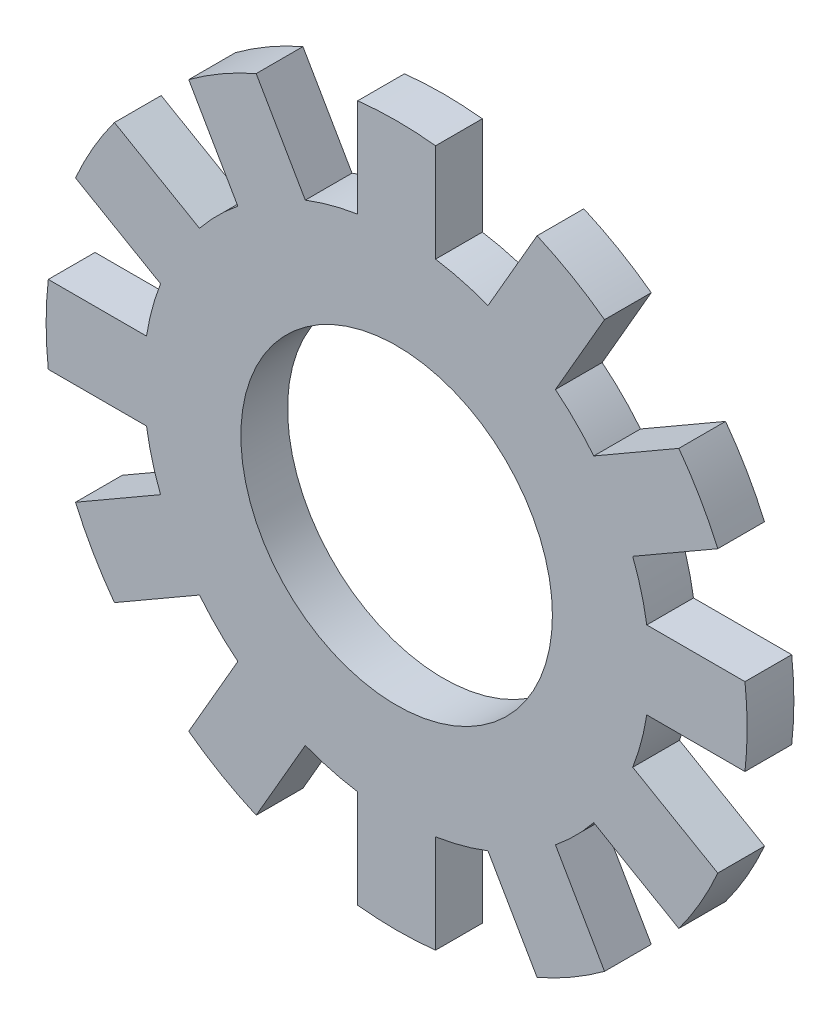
ISO-10303-21;
HEADER;
FILE_DESCRIPTION(('STEP AP214'),'2;1');
FILE_NAME('part.step','',(''),(''),'','','');
FILE_SCHEMA(('AUTOMOTIVE_DESIGN { 1 0 10303 214 1 1 1 1 }'));
ENDSEC;
DATA;
#1=APPLICATION_CONTEXT('core data for automotive mechanical design processes');
#2=APPLICATION_PROTOCOL_DEFINITION('international standard','automotive_design',2000,#1);
#3=PRODUCT_CONTEXT('',#1,'mechanical');
#4=PRODUCT('Part','Part','',(#3));
#5=PRODUCT_RELATED_PRODUCT_CATEGORY('part','',(#4));
#6=PRODUCT_DEFINITION_FORMATION('','',#4);
#7=PRODUCT_DEFINITION_CONTEXT('part definition',#1,'design');
#8=PRODUCT_DEFINITION('design','',#6,#7);
#9=PRODUCT_DEFINITION_SHAPE('','',#8);
#10=(LENGTH_UNIT() NAMED_UNIT(*) SI_UNIT(.MILLI.,.METRE.));
#11=(NAMED_UNIT(*) PLANE_ANGLE_UNIT() SI_UNIT($,.RADIAN.));
#12=(NAMED_UNIT(*) SI_UNIT($,.STERADIAN.) SOLID_ANGLE_UNIT());
#13=UNCERTAINTY_MEASURE_WITH_UNIT(LENGTH_MEASURE(1.E-05),#10,'distance_accuracy_value','');
#14=(GEOMETRIC_REPRESENTATION_CONTEXT(3) GLOBAL_UNCERTAINTY_ASSIGNED_CONTEXT((#13)) GLOBAL_UNIT_ASSIGNED_CONTEXT((#10,
#11,#12)) REPRESENTATION_CONTEXT('',''));
#15=CARTESIAN_POINT('',(0.,0.,0.));
#16=DIRECTION('',(0.,0.,1.));
#17=DIRECTION('',(1.,0.,0.));
#18=AXIS2_PLACEMENT_3D('',#15,#16,#17);
#19=CARTESIAN_POINT('',(0.,0.,0.15));
#20=DIRECTION('',(0.,0.,-1.));
#21=DIRECTION('',(-1.,0.,0.));
#22=AXIS2_PLACEMENT_3D('',#19,#20,#21);
#23=CYLINDRICAL_SURFACE('',#22,1.625);
#24=CARTESIAN_POINT('',(0.,0.,-0.15));
#25=DIRECTION('',(0.,0.,1.));
#26=DIRECTION('',(1.,0.,0.));
#27=AXIS2_PLACEMENT_3D('',#24,#25,#26);
#28=CIRCLE('',#27,1.625);
#29=CARTESIAN_POINT('',(1.26553721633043,1.0193333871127,-0.15));
#30=VERTEX_POINT('',#29);
#31=CARTESIAN_POINT('',(1.01933338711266,1.26553721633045,-0.15));
#32=VERTEX_POINT('',#31);
#33=EDGE_CURVE('E361',#30,#32,#28,.T.);
#34=ORIENTED_EDGE('',*,*,#33,.T.);
#35=DIRECTION('',(0.,0.,-1.));
#36=VECTOR('',#35,1.);
#37=CARTESIAN_POINT('',(1.01933338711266,1.26553721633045,0.15));
#38=LINE('',#37,#36);
#39=CARTESIAN_POINT('',(1.01933338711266,1.26553721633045,0.15));
#40=VERTEX_POINT('',#39);
#41=EDGE_CURVE('E352',#40,#32,#38,.T.);
#42=ORIENTED_EDGE('',*,*,#41,.F.);
#43=CARTESIAN_POINT('',(0.,0.,0.15));
#44=DIRECTION('',(0.,0.,1.));
#45=DIRECTION('',(1.,0.,0.));
#46=AXIS2_PLACEMENT_3D('',#43,#44,#45);
#47=CIRCLE('',#46,1.625);
#48=CARTESIAN_POINT('',(1.26553721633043,1.0193333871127,0.15));
#49=VERTEX_POINT('',#48);
#50=EDGE_CURVE('E64',#49,#40,#47,.T.);
#51=ORIENTED_EDGE('',*,*,#50,.F.);
#52=DIRECTION('',(0.,0.,-1.));
#53=VECTOR('',#52,1.);
#54=CARTESIAN_POINT('',(1.26553721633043,1.0193333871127,0.15));
#55=LINE('',#54,#53);
#56=EDGE_CURVE('E628',#49,#30,#55,.T.);
#57=ORIENTED_EDGE('',*,*,#56,.T.);
#58=EDGE_LOOP('',(#34,#42,#51,#57));
#59=FACE_BOUND('',#58,.T.);
#60=ADVANCED_FACE('F39',(#59),#23,.T.);
#61=DIRECTION('',(0.,0.,-1.));
#62=VECTOR('',#61,1.);
#63=CARTESIAN_POINT('',(0.586320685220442,1.51553721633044,0.15));
#64=LINE('',#63,#62);
#65=CARTESIAN_POINT('',(0.586320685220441,1.51553721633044,0.15));
#66=VERTEX_POINT('',#65);
#67=CARTESIAN_POINT('',(0.586320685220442,1.51553721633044,-0.15));
#68=VERTEX_POINT('',#67);
#69=EDGE_CURVE('E647',#66,#68,#64,.T.);
#70=ORIENTED_EDGE('',*,*,#69,.T.);
#71=CARTESIAN_POINT('',(0.25,1.60565407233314,-0.15));
#72=VERTEX_POINT('',#71);
#73=EDGE_CURVE('E388',#68,#72,#28,.T.);
#74=ORIENTED_EDGE('',*,*,#73,.T.);
#75=DIRECTION('',(0.,0.,-1.));
#76=VECTOR('',#75,1.);
#77=CARTESIAN_POINT('',(0.25,1.60565407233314,0.15));
#78=LINE('',#77,#76);
#79=CARTESIAN_POINT('',(0.25,1.60565407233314,0.15));
#80=VERTEX_POINT('',#79);
#81=EDGE_CURVE('E405',#80,#72,#78,.T.);
#82=ORIENTED_EDGE('',*,*,#81,.F.);
#83=EDGE_CURVE('E50',#66,#80,#47,.T.);
#84=ORIENTED_EDGE('',*,*,#83,.F.);
#85=EDGE_LOOP('',(#70,#74,#82,#84));
#86=FACE_BOUND('',#85,.T.);
#87=ADVANCED_FACE('F816',(#86),#23,.T.);
#88=CARTESIAN_POINT('',(1.60565407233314,0.250000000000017,-0.15));
#89=VERTEX_POINT('',#88);
#90=CARTESIAN_POINT('',(1.51553721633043,0.586320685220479,-0.15));
#91=VERTEX_POINT('',#90);
#92=EDGE_CURVE('E905',#89,#91,#28,.T.);
#93=ORIENTED_EDGE('',*,*,#92,.T.);
#94=DIRECTION('',(0.,0.,-1.));
#95=VECTOR('',#94,1.);
#96=CARTESIAN_POINT('',(1.51553721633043,0.586320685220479,0.15));
#97=LINE('',#96,#95);
#98=CARTESIAN_POINT('',(1.51553721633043,0.586320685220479,0.15));
#99=VERTEX_POINT('',#98);
#100=EDGE_CURVE('E785',#99,#91,#97,.T.);
#101=ORIENTED_EDGE('',*,*,#100,.F.);
#102=CARTESIAN_POINT('',(1.60565407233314,0.250000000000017,0.15));
#103=VERTEX_POINT('',#102);
#104=EDGE_CURVE('E371',#103,#99,#47,.T.);
#105=ORIENTED_EDGE('',*,*,#104,.F.);
#106=DIRECTION('',(0.,0.,-1.));
#107=VECTOR('',#106,1.);
#108=CARTESIAN_POINT('',(1.60565407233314,0.250000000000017,0.15));
#109=LINE('',#108,#107);
#110=EDGE_CURVE('E606',#103,#89,#109,.T.);
#111=ORIENTED_EDGE('',*,*,#110,.T.);
#112=EDGE_LOOP('',(#93,#101,#105,#111));
#113=FACE_BOUND('',#112,.T.);
#114=ADVANCED_FACE('F903',(#113),#23,.T.);
#115=CARTESIAN_POINT('',(1.51553721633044,-0.586320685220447,-0.15));
#116=VERTEX_POINT('',#115);
#117=CARTESIAN_POINT('',(1.60565407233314,-0.249999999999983,-0.15));
#118=VERTEX_POINT('',#117);
#119=EDGE_CURVE('E886',#116,#118,#28,.T.);
#120=ORIENTED_EDGE('',*,*,#119,.T.);
#121=DIRECTION('',(0.,0.,-1.));
#122=VECTOR('',#121,1.);
#123=CARTESIAN_POINT('',(1.60565407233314,-0.249999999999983,0.15));
#124=LINE('',#123,#122);
#125=CARTESIAN_POINT('',(1.60565407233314,-0.249999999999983,0.15));
#126=VERTEX_POINT('',#125);
#127=EDGE_CURVE('E771',#126,#118,#124,.T.);
#128=ORIENTED_EDGE('',*,*,#127,.F.);
#129=CARTESIAN_POINT('',(1.51553721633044,-0.586320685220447,0.15));
#130=VERTEX_POINT('',#129);
#131=EDGE_CURVE('E376',#130,#126,#47,.T.);
#132=ORIENTED_EDGE('',*,*,#131,.F.);
#133=DIRECTION('',(0.,0.,-1.));
#134=VECTOR('',#133,1.);
#135=CARTESIAN_POINT('',(1.51553721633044,-0.586320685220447,0.15));
#136=LINE('',#135,#134);
#137=EDGE_CURVE('E584',#130,#116,#136,.T.);
#138=ORIENTED_EDGE('',*,*,#137,.T.);
#139=EDGE_LOOP('',(#120,#128,#132,#138));
#140=FACE_BOUND('',#139,.T.);
#141=ADVANCED_FACE('F885',(#140),#23,.T.);
#142=CARTESIAN_POINT('',(1.01933338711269,-1.26553721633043,-0.15));
#143=VERTEX_POINT('',#142);
#144=CARTESIAN_POINT('',(1.26553721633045,-1.01933338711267,-0.15));
#145=VERTEX_POINT('',#144);
#146=EDGE_CURVE('E966',#143,#145,#28,.T.);
#147=ORIENTED_EDGE('',*,*,#146,.T.);
#148=DIRECTION('',(0.,0.,-1.));
#149=VECTOR('',#148,1.);
#150=CARTESIAN_POINT('',(1.26553721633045,-1.01933338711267,0.15));
#151=LINE('',#150,#149);
#152=CARTESIAN_POINT('',(1.26553721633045,-1.01933338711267,0.15));
#153=VERTEX_POINT('',#152);
#154=EDGE_CURVE('E757',#153,#145,#151,.T.);
#155=ORIENTED_EDGE('',*,*,#154,.F.);
#156=CARTESIAN_POINT('',(1.01933338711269,-1.26553721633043,0.15));
#157=VERTEX_POINT('',#156);
#158=EDGE_CURVE('E871',#157,#153,#47,.T.);
#159=ORIENTED_EDGE('',*,*,#158,.F.);
#160=DIRECTION('',(0.,0.,-1.));
#161=VECTOR('',#160,1.);
#162=CARTESIAN_POINT('',(1.01933338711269,-1.26553721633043,0.15));
#163=LINE('',#162,#161);
#164=EDGE_CURVE('E562',#157,#143,#163,.T.);
#165=ORIENTED_EDGE('',*,*,#164,.T.);
#166=EDGE_LOOP('',(#147,#155,#159,#165));
#167=FACE_BOUND('',#166,.T.);
#168=ADVANCED_FACE('F974',(#167),#23,.T.);
#169=CARTESIAN_POINT('',(0.25,-1.60565407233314,-0.15));
#170=VERTEX_POINT('',#169);
#171=CARTESIAN_POINT('',(0.586320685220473,-1.51553721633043,-0.15));
#172=VERTEX_POINT('',#171);
#173=EDGE_CURVE('E960',#170,#172,#28,.T.);
#174=ORIENTED_EDGE('',*,*,#173,.T.);
#175=DIRECTION('',(0.,0.,-1.));
#176=VECTOR('',#175,1.);
#177=CARTESIAN_POINT('',(0.586320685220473,-1.51553721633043,0.15));
#178=LINE('',#177,#176);
#179=CARTESIAN_POINT('',(0.586320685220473,-1.51553721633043,0.15));
#180=VERTEX_POINT('',#179);
#181=EDGE_CURVE('E743',#180,#172,#178,.T.);
#182=ORIENTED_EDGE('',*,*,#181,.F.);
#183=CARTESIAN_POINT('',(0.25,-1.60565407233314,0.15));
#184=VERTEX_POINT('',#183);
#185=EDGE_CURVE('E866',#184,#180,#47,.T.);
#186=ORIENTED_EDGE('',*,*,#185,.F.);
#187=DIRECTION('',(0.,0.,-1.));
#188=VECTOR('',#187,1.);
#189=CARTESIAN_POINT('',(0.25,-1.60565407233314,0.15));
#190=LINE('',#189,#188);
#191=EDGE_CURVE('E540',#184,#170,#190,.T.);
#192=ORIENTED_EDGE('',*,*,#191,.T.);
#193=EDGE_LOOP('',(#174,#182,#186,#192));
#194=FACE_BOUND('',#193,.T.);
#195=ADVANCED_FACE('F1402',(#194),#23,.T.);
#196=CARTESIAN_POINT('',(-0.586320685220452,-1.51553721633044,-0.15));
#197=VERTEX_POINT('',#196);
#198=CARTESIAN_POINT('',(-0.25,-1.60565407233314,-0.15));
#199=VERTEX_POINT('',#198);
#200=EDGE_CURVE('E955',#197,#199,#28,.T.);
#201=ORIENTED_EDGE('',*,*,#200,.T.);
#202=DIRECTION('',(0.,0.,-1.));
#203=VECTOR('',#202,1.);
#204=CARTESIAN_POINT('',(-0.25,-1.60565407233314,0.15));
#205=LINE('',#204,#203);
#206=CARTESIAN_POINT('',(-0.25,-1.60565407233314,0.15));
#207=VERTEX_POINT('',#206);
#208=EDGE_CURVE('E729',#207,#199,#205,.T.);
#209=ORIENTED_EDGE('',*,*,#208,.F.);
#210=CARTESIAN_POINT('',(-0.586320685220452,-1.51553721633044,0.15));
#211=VERTEX_POINT('',#210);
#212=EDGE_CURVE('E862',#211,#207,#47,.T.);
#213=ORIENTED_EDGE('',*,*,#212,.F.);
#214=DIRECTION('',(0.,0.,-1.));
#215=VECTOR('',#214,1.);
#216=CARTESIAN_POINT('',(-0.586320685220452,-1.51553721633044,0.15));
#217=LINE('',#216,#215);
#218=EDGE_CURVE('E518',#211,#197,#217,.T.);
#219=ORIENTED_EDGE('',*,*,#218,.T.);
#220=EDGE_LOOP('',(#201,#209,#213,#219));
#221=FACE_BOUND('',#220,.T.);
#222=ADVANCED_FACE('F1394',(#221),#23,.T.);
#223=CARTESIAN_POINT('',(-1.26553721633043,-1.01933338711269,-0.15));
#224=VERTEX_POINT('',#223);
#225=CARTESIAN_POINT('',(-1.01933338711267,-1.26553721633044,-0.15));
#226=VERTEX_POINT('',#225);
#227=EDGE_CURVE('E950',#224,#226,#28,.T.);
#228=ORIENTED_EDGE('',*,*,#227,.T.);
#229=DIRECTION('',(0.,0.,-1.));
#230=VECTOR('',#229,1.);
#231=CARTESIAN_POINT('',(-1.01933338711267,-1.26553721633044,0.15));
#232=LINE('',#231,#230);
#233=CARTESIAN_POINT('',(-1.01933338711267,-1.26553721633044,0.15));
#234=VERTEX_POINT('',#233);
#235=EDGE_CURVE('E715',#234,#226,#232,.T.);
#236=ORIENTED_EDGE('',*,*,#235,.F.);
#237=CARTESIAN_POINT('',(-1.26553721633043,-1.01933338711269,0.15));
#238=VERTEX_POINT('',#237);
#239=EDGE_CURVE('E858',#238,#234,#47,.T.);
#240=ORIENTED_EDGE('',*,*,#239,.F.);
#241=DIRECTION('',(0.,0.,-1.));
#242=VECTOR('',#241,1.);
#243=CARTESIAN_POINT('',(-1.26553721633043,-1.01933338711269,0.15));
#244=LINE('',#243,#242);
#245=EDGE_CURVE('E496',#238,#224,#244,.T.);
#246=ORIENTED_EDGE('',*,*,#245,.T.);
#247=EDGE_LOOP('',(#228,#236,#240,#246));
#248=FACE_BOUND('',#247,.T.);
#249=ADVANCED_FACE('F1386',(#248),#23,.T.);
#250=CARTESIAN_POINT('',(-1.60565407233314,-0.250000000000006,-0.15));
#251=VERTEX_POINT('',#250);
#252=CARTESIAN_POINT('',(-1.51553721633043,-0.586320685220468,-0.15));
#253=VERTEX_POINT('',#252);
#254=EDGE_CURVE('E947',#251,#253,#28,.T.);
#255=ORIENTED_EDGE('',*,*,#254,.T.);
#256=DIRECTION('',(0.,0.,-1.));
#257=VECTOR('',#256,1.);
#258=CARTESIAN_POINT('',(-1.51553721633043,-0.586320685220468,0.15));
#259=LINE('',#258,#257);
#260=CARTESIAN_POINT('',(-1.51553721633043,-0.586320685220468,0.15));
#261=VERTEX_POINT('',#260);
#262=EDGE_CURVE('E702',#261,#253,#259,.T.);
#263=ORIENTED_EDGE('',*,*,#262,.F.);
#264=CARTESIAN_POINT('',(-1.60565407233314,-0.250000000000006,0.15));
#265=VERTEX_POINT('',#264);
#266=EDGE_CURVE('E854',#265,#261,#47,.T.);
#267=ORIENTED_EDGE('',*,*,#266,.F.);
#268=DIRECTION('',(0.,0.,-1.));
#269=VECTOR('',#268,1.);
#270=CARTESIAN_POINT('',(-1.60565407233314,-0.250000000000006,0.15));
#271=LINE('',#270,#269);
#272=EDGE_CURVE('E474',#265,#251,#271,.T.);
#273=ORIENTED_EDGE('',*,*,#272,.T.);
#274=EDGE_LOOP('',(#255,#263,#267,#273));
#275=FACE_BOUND('',#274,.T.);
#276=ADVANCED_FACE('F938',(#275),#23,.T.);
#277=CARTESIAN_POINT('',(-1.51553721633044,0.586320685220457,-0.15));
#278=VERTEX_POINT('',#277);
#279=CARTESIAN_POINT('',(-1.60565407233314,0.249999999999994,-0.15));
#280=VERTEX_POINT('',#279);
#281=EDGE_CURVE('E943',#278,#280,#28,.T.);
#282=ORIENTED_EDGE('',*,*,#281,.T.);
#283=DIRECTION('',(0.,0.,-1.));
#284=VECTOR('',#283,1.);
#285=CARTESIAN_POINT('',(-1.60565407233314,0.249999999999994,0.15));
#286=LINE('',#285,#284);
#287=CARTESIAN_POINT('',(-1.60565407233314,0.249999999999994,0.15));
#288=VERTEX_POINT('',#287);
#289=EDGE_CURVE('E689',#288,#280,#286,.T.);
#290=ORIENTED_EDGE('',*,*,#289,.F.);
#291=CARTESIAN_POINT('',(-1.51553721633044,0.586320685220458,0.15));
#292=VERTEX_POINT('',#291);
#293=EDGE_CURVE('E851',#292,#288,#47,.T.);
#294=ORIENTED_EDGE('',*,*,#293,.F.);
#295=DIRECTION('',(0.,0.,-1.));
#296=VECTOR('',#295,1.);
#297=CARTESIAN_POINT('',(-1.51553721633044,0.586320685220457,0.15));
#298=LINE('',#297,#296);
#299=EDGE_CURVE('E452',#292,#278,#298,.T.);
#300=ORIENTED_EDGE('',*,*,#299,.T.);
#301=EDGE_LOOP('',(#282,#290,#294,#300));
#302=FACE_BOUND('',#301,.T.);
#303=ADVANCED_FACE('F934',(#302),#23,.T.);
#304=CARTESIAN_POINT('',(-1.01933338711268,1.26553721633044,-0.15));
#305=VERTEX_POINT('',#304);
#306=CARTESIAN_POINT('',(-1.26553721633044,1.01933338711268,-0.15));
#307=VERTEX_POINT('',#306);
#308=EDGE_CURVE('E941',#305,#307,#28,.T.);
#309=ORIENTED_EDGE('',*,*,#308,.T.);
#310=DIRECTION('',(0.,0.,-1.));
#311=VECTOR('',#310,1.);
#312=CARTESIAN_POINT('',(-1.26553721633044,1.01933338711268,0.15));
#313=LINE('',#312,#311);
#314=CARTESIAN_POINT('',(-1.26553721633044,1.01933338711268,0.15));
#315=VERTEX_POINT('',#314);
#316=EDGE_CURVE('E675',#315,#307,#313,.T.);
#317=ORIENTED_EDGE('',*,*,#316,.F.);
#318=CARTESIAN_POINT('',(-1.01933338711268,1.26553721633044,0.15));
#319=VERTEX_POINT('',#318);
#320=EDGE_CURVE('E49',#319,#315,#47,.T.);
#321=ORIENTED_EDGE('',*,*,#320,.F.);
#322=DIRECTION('',(0.,0.,-1.));
#323=VECTOR('',#322,1.);
#324=CARTESIAN_POINT('',(-1.01933338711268,1.26553721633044,0.15));
#325=LINE('',#324,#323);
#326=EDGE_CURVE('E430',#319,#305,#325,.T.);
#327=ORIENTED_EDGE('',*,*,#326,.T.);
#328=EDGE_LOOP('',(#309,#317,#321,#327));
#329=FACE_BOUND('',#328,.T.);
#330=ADVANCED_FACE('F928',(#329),#23,.T.);
#331=CARTESIAN_POINT('',(-0.25,1.60565407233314,-0.15));
#332=VERTEX_POINT('',#331);
#333=CARTESIAN_POINT('',(-0.586320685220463,1.51553721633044,-0.15));
#334=VERTEX_POINT('',#333);
#335=EDGE_CURVE('E43',#332,#334,#28,.T.);
#336=ORIENTED_EDGE('',*,*,#335,.T.);
#337=DIRECTION('',(0.,0.,-1.));
#338=VECTOR('',#337,1.);
#339=CARTESIAN_POINT('',(-0.586320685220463,1.51553721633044,0.15));
#340=LINE('',#339,#338);
#341=CARTESIAN_POINT('',(-0.586320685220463,1.51553721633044,0.15));
#342=VERTEX_POINT('',#341);
#343=EDGE_CURVE('E659',#342,#334,#340,.T.);
#344=ORIENTED_EDGE('',*,*,#343,.F.);
#345=CARTESIAN_POINT('',(-0.25,1.60565407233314,0.15));
#346=VERTEX_POINT('',#345);
#347=EDGE_CURVE('E11',#346,#342,#47,.T.);
#348=ORIENTED_EDGE('',*,*,#347,.F.);
#349=DIRECTION('',(0.,0.,-1.));
#350=VECTOR('',#349,1.);
#351=CARTESIAN_POINT('',(-0.25,1.60565407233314,0.15));
#352=LINE('',#351,#350);
#353=EDGE_CURVE('E392',#346,#332,#352,.T.);
#354=ORIENTED_EDGE('',*,*,#353,.T.);
#355=EDGE_LOOP('',(#336,#344,#348,#354));
#356=FACE_BOUND('',#355,.T.);
#357=ADVANCED_FACE('F41',(#356),#23,.T.);
#358=CARTESIAN_POINT('',(0.,0.,0.15));
#359=DIRECTION('',(0.,0.,1.));
#360=DIRECTION('',(1.,0.,0.));
#361=AXIS2_PLACEMENT_3D('',#358,#359,#360);
#362=PLANE('',#361);
#363=ORIENTED_EDGE('',*,*,#347,.T.);
#364=DIRECTION('',(0.500000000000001,-0.866025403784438,0.));
#365=VECTOR('',#364,1.);
#366=CARTESIAN_POINT('',(-0.901527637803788,2.06149167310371,0.15));
#367=LINE('',#366,#365);
#368=CARTESIAN_POINT('',(-0.901527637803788,2.06149167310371,0.15));
#369=VERTEX_POINT('',#368);
#370=EDGE_CURVE('E670',#369,#342,#367,.T.);
#371=ORIENTED_EDGE('',*,*,#370,.F.);
#372=CARTESIAN_POINT('',(0.,0.,0.15));
#373=DIRECTION('',(0.,0.,1.));
#374=DIRECTION('',(0.866025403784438,0.500000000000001,0.));
#375=AXIS2_PLACEMENT_3D('',#372,#373,#374);
#376=CIRCLE('',#375,2.25);
#377=CARTESIAN_POINT('',(-1.33454033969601,1.81149167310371,0.15));
#378=VERTEX_POINT('',#377);
#379=EDGE_CURVE('E439',#369,#378,#376,.T.);
#380=ORIENTED_EDGE('',*,*,#379,.T.);
#381=DIRECTION('',(0.500000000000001,-0.866025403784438,0.));
#382=VECTOR('',#381,1.);
#383=CARTESIAN_POINT('',(-1.33454033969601,1.81149167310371,0.15));
#384=LINE('',#383,#382);
#385=EDGE_CURVE('E434',#378,#319,#384,.T.);
#386=ORIENTED_EDGE('',*,*,#385,.T.);
#387=ORIENTED_EDGE('',*,*,#320,.T.);
#388=DIRECTION('',(0.86602540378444,-0.499999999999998,0.));
#389=VECTOR('',#388,1.);
#390=CARTESIAN_POINT('',(-1.81149167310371,1.334540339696,0.15));
#391=LINE('',#390,#389);
#392=CARTESIAN_POINT('',(-1.81149167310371,1.334540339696,0.15));
#393=VERTEX_POINT('',#392);
#394=EDGE_CURVE('E684',#393,#315,#391,.T.);
#395=ORIENTED_EDGE('',*,*,#394,.F.);
#396=CARTESIAN_POINT('',(0.,0.,0.15));
#397=DIRECTION('',(0.,0.,1.));
#398=DIRECTION('',(0.499999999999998,0.86602540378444,0.));
#399=AXIS2_PLACEMENT_3D('',#396,#397,#398);
#400=CIRCLE('',#399,2.25);
#401=CARTESIAN_POINT('',(-2.06149167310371,0.90152763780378,0.15));
#402=VERTEX_POINT('',#401);
#403=EDGE_CURVE('E461',#393,#402,#400,.T.);
#404=ORIENTED_EDGE('',*,*,#403,.T.);
#405=DIRECTION('',(0.86602540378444,-0.499999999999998,0.));
#406=VECTOR('',#405,1.);
#407=CARTESIAN_POINT('',(-2.06149167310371,0.90152763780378,0.15));
#408=LINE('',#407,#406);
#409=EDGE_CURVE('E456',#402,#292,#408,.T.);
#410=ORIENTED_EDGE('',*,*,#409,.T.);
#411=ORIENTED_EDGE('',*,*,#293,.T.);
#412=DIRECTION('',(1.,0.,0.));
#413=VECTOR('',#412,1.);
#414=CARTESIAN_POINT('',(-2.23606797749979,0.249999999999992,0.15));
#415=LINE('',#414,#413);
#416=CARTESIAN_POINT('',(-2.23606797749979,0.249999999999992,0.15));
#417=VERTEX_POINT('',#416);
#418=EDGE_CURVE('E697',#417,#288,#415,.T.);
#419=ORIENTED_EDGE('',*,*,#418,.F.);
#420=CARTESIAN_POINT('',(0.,0.,0.15));
#421=DIRECTION('',(0.,0.,1.));
#422=DIRECTION('',(0.,1.,0.));
#423=AXIS2_PLACEMENT_3D('',#420,#421,#422);
#424=CIRCLE('',#423,2.25);
#425=CARTESIAN_POINT('',(-2.23606797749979,-0.250000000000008,0.15));
#426=VERTEX_POINT('',#425);
#427=EDGE_CURVE('E483',#417,#426,#424,.T.);
#428=ORIENTED_EDGE('',*,*,#427,.T.);
#429=DIRECTION('',(1.,0.,0.));
#430=VECTOR('',#429,1.);
#431=CARTESIAN_POINT('',(-2.23606797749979,-0.250000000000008,0.15));
#432=LINE('',#431,#430);
#433=EDGE_CURVE('E478',#426,#265,#432,.T.);
#434=ORIENTED_EDGE('',*,*,#433,.T.);
#435=ORIENTED_EDGE('',*,*,#266,.T.);
#436=DIRECTION('',(0.866025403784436,0.500000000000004,0.));
#437=VECTOR('',#436,1.);
#438=CARTESIAN_POINT('',(-2.0614916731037,-0.901527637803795,0.15));
#439=LINE('',#438,#437);
#440=CARTESIAN_POINT('',(-2.0614916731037,-0.901527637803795,0.15));
#441=VERTEX_POINT('',#440);
#442=EDGE_CURVE('E710',#441,#261,#439,.T.);
#443=ORIENTED_EDGE('',*,*,#442,.F.);
#444=CARTESIAN_POINT('',(0.,0.,0.15));
#445=DIRECTION('',(0.,0.,1.));
#446=DIRECTION('',(-0.500000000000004,0.866025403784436,0.));
#447=AXIS2_PLACEMENT_3D('',#444,#445,#446);
#448=CIRCLE('',#447,2.25);
#449=CARTESIAN_POINT('',(-1.8114916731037,-1.33454033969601,0.15));
#450=VERTEX_POINT('',#449);
#451=EDGE_CURVE('E505',#441,#450,#448,.T.);
#452=ORIENTED_EDGE('',*,*,#451,.T.);
#453=DIRECTION('',(0.866025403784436,0.500000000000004,0.));
#454=VECTOR('',#453,1.);
#455=CARTESIAN_POINT('',(-1.8114916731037,-1.33454033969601,0.15));
#456=LINE('',#455,#454);
#457=EDGE_CURVE('E500',#450,#238,#456,.T.);
#458=ORIENTED_EDGE('',*,*,#457,.T.);
#459=ORIENTED_EDGE('',*,*,#239,.T.);
#460=DIRECTION('',(0.499999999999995,0.866025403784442,0.));
#461=VECTOR('',#460,1.);
#462=CARTESIAN_POINT('',(-1.33454033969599,-1.81149167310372,0.15));
#463=LINE('',#462,#461);
#464=CARTESIAN_POINT('',(-1.33454033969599,-1.81149167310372,0.15));
#465=VERTEX_POINT('',#464);
#466=EDGE_CURVE('E724',#465,#234,#463,.T.);
#467=ORIENTED_EDGE('',*,*,#466,.F.);
#468=CARTESIAN_POINT('',(0.,0.,0.15));
#469=DIRECTION('',(0.,0.,1.));
#470=DIRECTION('',(-0.866025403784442,0.499999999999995,0.));
#471=AXIS2_PLACEMENT_3D('',#468,#469,#470);
#472=CIRCLE('',#471,2.25);
#473=CARTESIAN_POINT('',(-0.901527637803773,-2.06149167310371,0.15));
#474=VERTEX_POINT('',#473);
#475=EDGE_CURVE('E527',#465,#474,#472,.T.);
#476=ORIENTED_EDGE('',*,*,#475,.T.);
#477=DIRECTION('',(0.499999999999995,0.866025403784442,0.));
#478=VECTOR('',#477,1.);
#479=CARTESIAN_POINT('',(-0.901527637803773,-2.06149167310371,0.15));
#480=LINE('',#479,#478);
#481=EDGE_CURVE('E522',#474,#211,#480,.T.);
#482=ORIENTED_EDGE('',*,*,#481,.T.);
#483=ORIENTED_EDGE('',*,*,#212,.T.);
#484=DIRECTION('',(0.,1.,0.));
#485=VECTOR('',#484,1.);
#486=CARTESIAN_POINT('',(-0.25,-2.23606797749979,0.15));
#487=LINE('',#486,#485);
#488=CARTESIAN_POINT('',(-0.25,-2.23606797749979,0.15));
#489=VERTEX_POINT('',#488);
#490=EDGE_CURVE('E738',#489,#207,#487,.T.);
#491=ORIENTED_EDGE('',*,*,#490,.F.);
#492=CARTESIAN_POINT('',(0.,0.,0.15));
#493=DIRECTION('',(0.,0.,1.));
#494=DIRECTION('',(-1.,0.,0.));
#495=AXIS2_PLACEMENT_3D('',#492,#493,#494);
#496=CIRCLE('',#495,2.25);
#497=CARTESIAN_POINT('',(0.25,-2.23606797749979,0.15));
#498=VERTEX_POINT('',#497);
#499=EDGE_CURVE('E549',#489,#498,#496,.T.);
#500=ORIENTED_EDGE('',*,*,#499,.T.);
#501=DIRECTION('',(0.,1.,0.));
#502=VECTOR('',#501,1.);
#503=CARTESIAN_POINT('',(0.25,-2.23606797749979,0.15));
#504=LINE('',#503,#502);
#505=EDGE_CURVE('E544',#498,#184,#504,.T.);
#506=ORIENTED_EDGE('',*,*,#505,.T.);
#507=ORIENTED_EDGE('',*,*,#185,.T.);
#508=DIRECTION('',(-0.500000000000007,0.866025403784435,0.));
#509=VECTOR('',#508,1.);
#510=CARTESIAN_POINT('',(0.901527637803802,-2.0614916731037,0.15));
#511=LINE('',#510,#509);
#512=CARTESIAN_POINT('',(0.901527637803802,-2.0614916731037,0.15));
#513=VERTEX_POINT('',#512);
#514=EDGE_CURVE('E752',#513,#180,#511,.T.);
#515=ORIENTED_EDGE('',*,*,#514,.F.);
#516=CARTESIAN_POINT('',(0.,0.,0.15));
#517=DIRECTION('',(0.,0.,1.));
#518=DIRECTION('',(-0.866025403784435,-0.500000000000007,0.));
#519=AXIS2_PLACEMENT_3D('',#516,#517,#518);
#520=CIRCLE('',#519,2.25);
#521=CARTESIAN_POINT('',(1.33454033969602,-1.8114916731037,0.15));
#522=VERTEX_POINT('',#521);
#523=EDGE_CURVE('E571',#513,#522,#520,.T.);
#524=ORIENTED_EDGE('',*,*,#523,.T.);
#525=DIRECTION('',(-0.500000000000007,0.866025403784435,0.));
#526=VECTOR('',#525,1.);
#527=CARTESIAN_POINT('',(1.33454033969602,-1.8114916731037,0.15));
#528=LINE('',#527,#526);
#529=EDGE_CURVE('E566',#522,#157,#528,.T.);
#530=ORIENTED_EDGE('',*,*,#529,.T.);
#531=ORIENTED_EDGE('',*,*,#158,.T.);
#532=DIRECTION('',(-0.866025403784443,0.499999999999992,0.));
#533=VECTOR('',#532,1.);
#534=CARTESIAN_POINT('',(1.81149167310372,-1.33454033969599,0.15));
#535=LINE('',#534,#533);
#536=CARTESIAN_POINT('',(1.81149167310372,-1.33454033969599,0.15));
#537=VERTEX_POINT('',#536);
#538=EDGE_CURVE('E766',#537,#153,#535,.T.);
#539=ORIENTED_EDGE('',*,*,#538,.F.);
#540=CARTESIAN_POINT('',(0.,0.,0.15));
#541=DIRECTION('',(0.,0.,1.));
#542=DIRECTION('',(-0.499999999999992,-0.866025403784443,0.));
#543=AXIS2_PLACEMENT_3D('',#540,#541,#542);
#544=CIRCLE('',#543,2.25);
#545=CARTESIAN_POINT('',(2.06149167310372,-0.901527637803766,0.15));
#546=VERTEX_POINT('',#545);
#547=EDGE_CURVE('E593',#537,#546,#544,.T.);
#548=ORIENTED_EDGE('',*,*,#547,.T.);
#549=DIRECTION('',(-0.866025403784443,0.499999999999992,0.));
#550=VECTOR('',#549,1.);
#551=CARTESIAN_POINT('',(2.06149167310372,-0.901527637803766,0.15));
#552=LINE('',#551,#550);
#553=EDGE_CURVE('E588',#546,#130,#552,.T.);
#554=ORIENTED_EDGE('',*,*,#553,.T.);
#555=ORIENTED_EDGE('',*,*,#131,.T.);
#556=DIRECTION('',(-1.,0.,0.));
#557=VECTOR('',#556,1.);
#558=CARTESIAN_POINT('',(2.23606797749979,-0.249999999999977,0.15));
#559=LINE('',#558,#557);
#560=CARTESIAN_POINT('',(2.23606797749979,-0.249999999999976,0.15));
#561=VERTEX_POINT('',#560);
#562=EDGE_CURVE('E780',#561,#126,#559,.T.);
#563=ORIENTED_EDGE('',*,*,#562,.F.);
#564=CARTESIAN_POINT('',(0.,0.,0.15));
#565=DIRECTION('',(0.,0.,1.));
#566=DIRECTION('',(0.,-1.,0.));
#567=AXIS2_PLACEMENT_3D('',#564,#565,#566);
#568=CIRCLE('',#567,2.25);
#569=CARTESIAN_POINT('',(2.23606797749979,0.250000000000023,0.15));
#570=VERTEX_POINT('',#569);
#571=EDGE_CURVE('E615',#561,#570,#568,.T.);
#572=ORIENTED_EDGE('',*,*,#571,.T.);
#573=DIRECTION('',(-1.,0.,0.));
#574=VECTOR('',#573,1.);
#575=CARTESIAN_POINT('',(2.23606797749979,0.250000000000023,0.15));
#576=LINE('',#575,#574);
#577=EDGE_CURVE('E610',#570,#103,#576,.T.);
#578=ORIENTED_EDGE('',*,*,#577,.T.);
#579=ORIENTED_EDGE('',*,*,#104,.T.);
#580=DIRECTION('',(-0.866025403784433,-0.50000000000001,0.));
#581=VECTOR('',#580,1.);
#582=CARTESIAN_POINT('',(2.0614916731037,0.901527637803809,0.15));
#583=LINE('',#582,#581);
#584=CARTESIAN_POINT('',(2.0614916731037,0.901527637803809,0.15));
#585=VERTEX_POINT('',#584);
#586=EDGE_CURVE('E794',#585,#99,#583,.T.);
#587=ORIENTED_EDGE('',*,*,#586,.F.);
#588=CARTESIAN_POINT('',(0.,0.,0.15));
#589=DIRECTION('',(0.,0.,1.));
#590=DIRECTION('',(0.50000000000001,-0.866025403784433,0.));
#591=AXIS2_PLACEMENT_3D('',#588,#589,#590);
#592=CIRCLE('',#591,2.25);
#593=CARTESIAN_POINT('',(1.81149167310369,1.33454033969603,0.15));
#594=VERTEX_POINT('',#593);
#595=EDGE_CURVE('E635',#585,#594,#592,.T.);
#596=ORIENTED_EDGE('',*,*,#595,.T.);
#597=DIRECTION('',(-0.866025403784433,-0.50000000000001,0.));
#598=VECTOR('',#597,1.);
#599=CARTESIAN_POINT('',(1.81149167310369,1.33454033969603,0.15));
#600=LINE('',#599,#598);
#601=EDGE_CURVE('E368',#594,#49,#600,.T.);
#602=ORIENTED_EDGE('',*,*,#601,.T.);
#603=ORIENTED_EDGE('',*,*,#50,.T.);
#604=DIRECTION('',(-0.499999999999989,-0.866025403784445,0.));
#605=VECTOR('',#604,1.);
#606=CARTESIAN_POINT('',(1.33454033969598,1.81149167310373,0.15));
#607=LINE('',#606,#605);
#608=CARTESIAN_POINT('',(1.33454033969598,1.81149167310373,0.15));
#609=VERTEX_POINT('',#608);
#610=EDGE_CURVE('E349',#609,#40,#607,.T.);
#611=ORIENTED_EDGE('',*,*,#610,.F.);
#612=CARTESIAN_POINT('',(0.,0.,0.15));
#613=DIRECTION('',(0.,0.,1.));
#614=DIRECTION('',(0.866025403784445,-0.499999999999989,0.));
#615=AXIS2_PLACEMENT_3D('',#612,#613,#614);
#616=CIRCLE('',#615,2.25);
#617=CARTESIAN_POINT('',(0.901527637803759,2.06149167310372,0.15));
#618=VERTEX_POINT('',#617);
#619=EDGE_CURVE('E655',#609,#618,#616,.T.);
#620=ORIENTED_EDGE('',*,*,#619,.T.);
#621=DIRECTION('',(-0.499999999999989,-0.866025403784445,0.));
#622=VECTOR('',#621,1.);
#623=CARTESIAN_POINT('',(0.901527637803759,2.06149167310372,0.15));
#624=LINE('',#623,#622);
#625=EDGE_CURVE('E650',#618,#66,#624,.T.);
#626=ORIENTED_EDGE('',*,*,#625,.T.);
#627=ORIENTED_EDGE('',*,*,#83,.T.);
#628=DIRECTION('',(0.,-1.,0.));
#629=VECTOR('',#628,1.);
#630=CARTESIAN_POINT('',(0.25,2.23606797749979,0.15));
#631=LINE('',#630,#629);
#632=CARTESIAN_POINT('',(0.25,2.23606797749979,0.15));
#633=VERTEX_POINT('',#632);
#634=EDGE_CURVE('E418',#633,#80,#631,.T.);
#635=ORIENTED_EDGE('',*,*,#634,.F.);
#636=CARTESIAN_POINT('',(0.,0.,0.15));
#637=DIRECTION('',(0.,0.,1.));
#638=DIRECTION('',(1.,0.,0.));
#639=AXIS2_PLACEMENT_3D('',#636,#637,#638);
#640=CIRCLE('',#639,2.25);
#641=CARTESIAN_POINT('',(-0.25,2.23606797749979,0.15));
#642=VERTEX_POINT('',#641);
#643=EDGE_CURVE('E401',#633,#642,#640,.T.);
#644=ORIENTED_EDGE('',*,*,#643,.T.);
#645=DIRECTION('',(0.,-1.,0.));
#646=VECTOR('',#645,1.);
#647=CARTESIAN_POINT('',(-0.25,2.23606797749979,0.15));
#648=LINE('',#647,#646);
#649=EDGE_CURVE('E396',#642,#346,#648,.T.);
#650=ORIENTED_EDGE('',*,*,#649,.T.);
#651=EDGE_LOOP('',(#363,#371,#380,#386,#387,#395,#404,#410,#411,#419,#428,#434,#435,#443,#452,
#458,#459,#467,#476,#482,#483,#491,#500,#506,#507,#515,#524,#530,#531,#539,#548,#554,#555,#563,
#572,#578,#579,#587,#596,#602,#603,#611,#620,#626,#627,#635,#644,#650));
#652=FACE_BOUND('',#651,.T.);
#653=CARTESIAN_POINT('',(0.,0.,0.15));
#654=DIRECTION('',(0.,0.,1.));
#655=DIRECTION('',(1.,0.,0.));
#656=AXIS2_PLACEMENT_3D('',#653,#654,#655);
#657=CIRCLE('',#656,1.);
#658=CARTESIAN_POINT('',(1.,0.,0.15));
#659=VERTEX_POINT('',#658);
#660=EDGE_CURVE('E383',#659,#659,#657,.T.);
#661=ORIENTED_EDGE('',*,*,#660,.F.);
#662=EDGE_LOOP('',(#661));
#663=FACE_BOUND('',#662,.T.);
#664=ADVANCED_FACE('F365',(#652,#663),#362,.T.);
#665=CARTESIAN_POINT('',(0.,0.,-0.15));
#666=DIRECTION('',(0.,0.,1.));
#667=DIRECTION('',(1.,0.,0.));
#668=AXIS2_PLACEMENT_3D('',#665,#666,#667);
#669=PLANE('',#668);
#670=ORIENTED_EDGE('',*,*,#335,.F.);
#671=DIRECTION('',(0.,-1.,0.));
#672=VECTOR('',#671,1.);
#673=CARTESIAN_POINT('',(-0.25,2.23606797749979,-0.15));
#674=LINE('',#673,#672);
#675=CARTESIAN_POINT('',(-0.25,2.23606797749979,-0.15));
#676=VERTEX_POINT('',#675);
#677=EDGE_CURVE('E397',#676,#332,#674,.T.);
#678=ORIENTED_EDGE('',*,*,#677,.F.);
#679=CARTESIAN_POINT('',(0.,0.,-0.15));
#680=DIRECTION('',(0.,0.,1.));
#681=DIRECTION('',(1.,0.,0.));
#682=AXIS2_PLACEMENT_3D('',#679,#680,#681);
#683=CIRCLE('',#682,2.25);
#684=CARTESIAN_POINT('',(0.25,2.23606797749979,-0.15));
#685=VERTEX_POINT('',#684);
#686=EDGE_CURVE('E402',#685,#676,#683,.T.);
#687=ORIENTED_EDGE('',*,*,#686,.F.);
#688=DIRECTION('',(0.,-1.,0.));
#689=VECTOR('',#688,1.);
#690=CARTESIAN_POINT('',(0.25,2.23606797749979,-0.15));
#691=LINE('',#690,#689);
#692=EDGE_CURVE('E419',#685,#72,#691,.T.);
#693=ORIENTED_EDGE('',*,*,#692,.T.);
#694=ORIENTED_EDGE('',*,*,#73,.F.);
#695=DIRECTION('',(-0.499999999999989,-0.866025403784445,0.));
#696=VECTOR('',#695,1.);
#697=CARTESIAN_POINT('',(0.901527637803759,2.06149167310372,-0.15));
#698=LINE('',#697,#696);
#699=CARTESIAN_POINT('',(0.901527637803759,2.06149167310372,-0.15));
#700=VERTEX_POINT('',#699);
#701=EDGE_CURVE('E651',#700,#68,#698,.T.);
#702=ORIENTED_EDGE('',*,*,#701,.F.);
#703=CARTESIAN_POINT('',(0.,0.,-0.15));
#704=DIRECTION('',(0.,0.,1.));
#705=DIRECTION('',(0.866025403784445,-0.499999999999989,0.));
#706=AXIS2_PLACEMENT_3D('',#703,#704,#705);
#707=CIRCLE('',#706,2.25);
#708=CARTESIAN_POINT('',(1.33454033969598,1.81149167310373,-0.15));
#709=VERTEX_POINT('',#708);
#710=EDGE_CURVE('E656',#709,#700,#707,.T.);
#711=ORIENTED_EDGE('',*,*,#710,.F.);
#712=DIRECTION('',(-0.499999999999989,-0.866025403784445,0.));
#713=VECTOR('',#712,1.);
#714=CARTESIAN_POINT('',(1.33454033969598,1.81149167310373,-0.15));
#715=LINE('',#714,#713);
#716=EDGE_CURVE('E358',#709,#32,#715,.T.);
#717=ORIENTED_EDGE('',*,*,#716,.T.);
#718=ORIENTED_EDGE('',*,*,#33,.F.);
#719=DIRECTION('',(-0.866025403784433,-0.50000000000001,0.));
#720=VECTOR('',#719,1.);
#721=CARTESIAN_POINT('',(1.81149167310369,1.33454033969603,-0.15));
#722=LINE('',#721,#720);
#723=CARTESIAN_POINT('',(1.81149167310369,1.33454033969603,-0.15));
#724=VERTEX_POINT('',#723);
#725=EDGE_CURVE('E631',#724,#30,#722,.T.);
#726=ORIENTED_EDGE('',*,*,#725,.F.);
#727=CARTESIAN_POINT('',(0.,0.,-0.15));
#728=DIRECTION('',(0.,0.,1.));
#729=DIRECTION('',(0.50000000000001,-0.866025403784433,0.));
#730=AXIS2_PLACEMENT_3D('',#727,#728,#729);
#731=CIRCLE('',#730,2.25);
#732=CARTESIAN_POINT('',(2.0614916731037,0.901527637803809,-0.15));
#733=VERTEX_POINT('',#732);
#734=EDGE_CURVE('E636',#733,#724,#731,.T.);
#735=ORIENTED_EDGE('',*,*,#734,.F.);
#736=DIRECTION('',(-0.866025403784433,-0.50000000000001,0.));
#737=VECTOR('',#736,1.);
#738=CARTESIAN_POINT('',(2.0614916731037,0.901527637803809,-0.15));
#739=LINE('',#738,#737);
#740=EDGE_CURVE('E363',#733,#91,#739,.T.);
#741=ORIENTED_EDGE('',*,*,#740,.T.);
#742=ORIENTED_EDGE('',*,*,#92,.F.);
#743=DIRECTION('',(-1.,0.,0.));
#744=VECTOR('',#743,1.);
#745=CARTESIAN_POINT('',(2.23606797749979,0.250000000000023,-0.15));
#746=LINE('',#745,#744);
#747=CARTESIAN_POINT('',(2.23606797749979,0.250000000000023,-0.15));
#748=VERTEX_POINT('',#747);
#749=EDGE_CURVE('E611',#748,#89,#746,.T.);
#750=ORIENTED_EDGE('',*,*,#749,.F.);
#751=CARTESIAN_POINT('',(0.,0.,-0.15));
#752=DIRECTION('',(0.,0.,1.));
#753=DIRECTION('',(0.,-1.,0.));
#754=AXIS2_PLACEMENT_3D('',#751,#752,#753);
#755=CIRCLE('',#754,2.25);
#756=CARTESIAN_POINT('',(2.23606797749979,-0.249999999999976,-0.15));
#757=VERTEX_POINT('',#756);
#758=EDGE_CURVE('E616',#757,#748,#755,.T.);
#759=ORIENTED_EDGE('',*,*,#758,.F.);
#760=DIRECTION('',(-1.,0.,0.));
#761=VECTOR('',#760,1.);
#762=CARTESIAN_POINT('',(2.23606797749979,-0.249999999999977,-0.15));
#763=LINE('',#762,#761);
#764=EDGE_CURVE('E781',#757,#118,#763,.T.);
#765=ORIENTED_EDGE('',*,*,#764,.T.);
#766=ORIENTED_EDGE('',*,*,#119,.F.);
#767=DIRECTION('',(-0.866025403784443,0.499999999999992,0.));
#768=VECTOR('',#767,1.);
#769=CARTESIAN_POINT('',(2.06149167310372,-0.901527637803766,-0.15));
#770=LINE('',#769,#768);
#771=CARTESIAN_POINT('',(2.06149167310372,-0.901527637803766,-0.15));
#772=VERTEX_POINT('',#771);
#773=EDGE_CURVE('E589',#772,#116,#770,.T.);
#774=ORIENTED_EDGE('',*,*,#773,.F.);
#775=CARTESIAN_POINT('',(0.,0.,-0.15));
#776=DIRECTION('',(0.,0.,1.));
#777=DIRECTION('',(-0.499999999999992,-0.866025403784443,0.));
#778=AXIS2_PLACEMENT_3D('',#775,#776,#777);
#779=CIRCLE('',#778,2.25);
#780=CARTESIAN_POINT('',(1.81149167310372,-1.33454033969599,-0.15));
#781=VERTEX_POINT('',#780);
#782=EDGE_CURVE('E594',#781,#772,#779,.T.);
#783=ORIENTED_EDGE('',*,*,#782,.F.);
#784=DIRECTION('',(-0.866025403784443,0.499999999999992,0.));
#785=VECTOR('',#784,1.);
#786=CARTESIAN_POINT('',(1.81149167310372,-1.33454033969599,-0.15));
#787=LINE('',#786,#785);
#788=EDGE_CURVE('E767',#781,#145,#787,.T.);
#789=ORIENTED_EDGE('',*,*,#788,.T.);
#790=ORIENTED_EDGE('',*,*,#146,.F.);
#791=DIRECTION('',(-0.500000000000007,0.866025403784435,0.));
#792=VECTOR('',#791,1.);
#793=CARTESIAN_POINT('',(1.33454033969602,-1.8114916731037,-0.15));
#794=LINE('',#793,#792);
#795=CARTESIAN_POINT('',(1.33454033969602,-1.8114916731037,-0.15));
#796=VERTEX_POINT('',#795);
#797=EDGE_CURVE('E567',#796,#143,#794,.T.);
#798=ORIENTED_EDGE('',*,*,#797,.F.);
#799=CARTESIAN_POINT('',(0.,0.,-0.15));
#800=DIRECTION('',(0.,0.,1.));
#801=DIRECTION('',(-0.866025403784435,-0.500000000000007,0.));
#802=AXIS2_PLACEMENT_3D('',#799,#800,#801);
#803=CIRCLE('',#802,2.25);
#804=CARTESIAN_POINT('',(0.901527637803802,-2.0614916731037,-0.15));
#805=VERTEX_POINT('',#804);
#806=EDGE_CURVE('E572',#805,#796,#803,.T.);
#807=ORIENTED_EDGE('',*,*,#806,.F.);
#808=DIRECTION('',(-0.500000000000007,0.866025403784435,0.));
#809=VECTOR('',#808,1.);
#810=CARTESIAN_POINT('',(0.901527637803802,-2.0614916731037,-0.15));
#811=LINE('',#810,#809);
#812=EDGE_CURVE('E753',#805,#172,#811,.T.);
#813=ORIENTED_EDGE('',*,*,#812,.T.);
#814=ORIENTED_EDGE('',*,*,#173,.F.);
#815=DIRECTION('',(0.,1.,0.));
#816=VECTOR('',#815,1.);
#817=CARTESIAN_POINT('',(0.25,-2.23606797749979,-0.15));
#818=LINE('',#817,#816);
#819=CARTESIAN_POINT('',(0.25,-2.23606797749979,-0.15));
#820=VERTEX_POINT('',#819);
#821=EDGE_CURVE('E545',#820,#170,#818,.T.);
#822=ORIENTED_EDGE('',*,*,#821,.F.);
#823=CARTESIAN_POINT('',(0.,0.,-0.15));
#824=DIRECTION('',(0.,0.,1.));
#825=DIRECTION('',(-1.,0.,0.));
#826=AXIS2_PLACEMENT_3D('',#823,#824,#825);
#827=CIRCLE('',#826,2.25);
#828=CARTESIAN_POINT('',(-0.25,-2.23606797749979,-0.15));
#829=VERTEX_POINT('',#828);
#830=EDGE_CURVE('E550',#829,#820,#827,.T.);
#831=ORIENTED_EDGE('',*,*,#830,.F.);
#832=DIRECTION('',(0.,1.,0.));
#833=VECTOR('',#832,1.);
#834=CARTESIAN_POINT('',(-0.25,-2.23606797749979,-0.15));
#835=LINE('',#834,#833);
#836=EDGE_CURVE('E739',#829,#199,#835,.T.);
#837=ORIENTED_EDGE('',*,*,#836,.T.);
#838=ORIENTED_EDGE('',*,*,#200,.F.);
#839=DIRECTION('',(0.499999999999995,0.866025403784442,0.));
#840=VECTOR('',#839,1.);
#841=CARTESIAN_POINT('',(-0.901527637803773,-2.06149167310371,-0.15));
#842=LINE('',#841,#840);
#843=CARTESIAN_POINT('',(-0.901527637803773,-2.06149167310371,-0.15));
#844=VERTEX_POINT('',#843);
#845=EDGE_CURVE('E523',#844,#197,#842,.T.);
#846=ORIENTED_EDGE('',*,*,#845,.F.);
#847=CARTESIAN_POINT('',(0.,0.,-0.15));
#848=DIRECTION('',(0.,0.,1.));
#849=DIRECTION('',(-0.866025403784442,0.499999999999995,0.));
#850=AXIS2_PLACEMENT_3D('',#847,#848,#849);
#851=CIRCLE('',#850,2.25);
#852=CARTESIAN_POINT('',(-1.33454033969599,-1.81149167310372,-0.15));
#853=VERTEX_POINT('',#852);
#854=EDGE_CURVE('E528',#853,#844,#851,.T.);
#855=ORIENTED_EDGE('',*,*,#854,.F.);
#856=DIRECTION('',(0.499999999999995,0.866025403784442,0.));
#857=VECTOR('',#856,1.);
#858=CARTESIAN_POINT('',(-1.33454033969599,-1.81149167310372,-0.15));
#859=LINE('',#858,#857);
#860=EDGE_CURVE('E725',#853,#226,#859,.T.);
#861=ORIENTED_EDGE('',*,*,#860,.T.);
#862=ORIENTED_EDGE('',*,*,#227,.F.);
#863=DIRECTION('',(0.866025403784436,0.500000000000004,0.));
#864=VECTOR('',#863,1.);
#865=CARTESIAN_POINT('',(-1.8114916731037,-1.33454033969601,-0.15));
#866=LINE('',#865,#864);
#867=CARTESIAN_POINT('',(-1.8114916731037,-1.33454033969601,-0.15));
#868=VERTEX_POINT('',#867);
#869=EDGE_CURVE('E501',#868,#224,#866,.T.);
#870=ORIENTED_EDGE('',*,*,#869,.F.);
#871=CARTESIAN_POINT('',(0.,0.,-0.15));
#872=DIRECTION('',(0.,0.,1.));
#873=DIRECTION('',(-0.500000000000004,0.866025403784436,0.));
#874=AXIS2_PLACEMENT_3D('',#871,#872,#873);
#875=CIRCLE('',#874,2.25);
#876=CARTESIAN_POINT('',(-2.0614916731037,-0.901527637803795,-0.15));
#877=VERTEX_POINT('',#876);
#878=EDGE_CURVE('E506',#877,#868,#875,.T.);
#879=ORIENTED_EDGE('',*,*,#878,.F.);
#880=DIRECTION('',(0.866025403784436,0.500000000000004,0.));
#881=VECTOR('',#880,1.);
#882=CARTESIAN_POINT('',(-2.0614916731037,-0.901527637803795,-0.15));
#883=LINE('',#882,#881);
#884=EDGE_CURVE('E711',#877,#253,#883,.T.);
#885=ORIENTED_EDGE('',*,*,#884,.T.);
#886=ORIENTED_EDGE('',*,*,#254,.F.);
#887=DIRECTION('',(1.,0.,0.));
#888=VECTOR('',#887,1.);
#889=CARTESIAN_POINT('',(-2.23606797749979,-0.250000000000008,-0.15));
#890=LINE('',#889,#888);
#891=CARTESIAN_POINT('',(-2.23606797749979,-0.250000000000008,-0.15));
#892=VERTEX_POINT('',#891);
#893=EDGE_CURVE('E479',#892,#251,#890,.T.);
#894=ORIENTED_EDGE('',*,*,#893,.F.);
#895=CARTESIAN_POINT('',(0.,0.,-0.15));
#896=DIRECTION('',(0.,0.,1.));
#897=DIRECTION('',(0.,1.,0.));
#898=AXIS2_PLACEMENT_3D('',#895,#896,#897);
#899=CIRCLE('',#898,2.25);
#900=CARTESIAN_POINT('',(-2.23606797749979,0.249999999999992,-0.15));
#901=VERTEX_POINT('',#900);
#902=EDGE_CURVE('E484',#901,#892,#899,.T.);
#903=ORIENTED_EDGE('',*,*,#902,.F.);
#904=DIRECTION('',(1.,0.,0.));
#905=VECTOR('',#904,1.);
#906=CARTESIAN_POINT('',(-2.23606797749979,0.249999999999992,-0.15));
#907=LINE('',#906,#905);
#908=EDGE_CURVE('E698',#901,#280,#907,.T.);
#909=ORIENTED_EDGE('',*,*,#908,.T.);
#910=ORIENTED_EDGE('',*,*,#281,.F.);
#911=DIRECTION('',(0.86602540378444,-0.499999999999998,0.));
#912=VECTOR('',#911,1.);
#913=CARTESIAN_POINT('',(-2.06149167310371,0.90152763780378,-0.15));
#914=LINE('',#913,#912);
#915=CARTESIAN_POINT('',(-2.06149167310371,0.90152763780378,-0.15));
#916=VERTEX_POINT('',#915);
#917=EDGE_CURVE('E457',#916,#278,#914,.T.);
#918=ORIENTED_EDGE('',*,*,#917,.F.);
#919=CARTESIAN_POINT('',(0.,0.,-0.15));
#920=DIRECTION('',(0.,0.,1.));
#921=DIRECTION('',(0.499999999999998,0.86602540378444,0.));
#922=AXIS2_PLACEMENT_3D('',#919,#920,#921);
#923=CIRCLE('',#922,2.25);
#924=CARTESIAN_POINT('',(-1.81149167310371,1.334540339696,-0.15));
#925=VERTEX_POINT('',#924);
#926=EDGE_CURVE('E462',#925,#916,#923,.T.);
#927=ORIENTED_EDGE('',*,*,#926,.F.);
#928=DIRECTION('',(0.86602540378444,-0.499999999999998,0.));
#929=VECTOR('',#928,1.);
#930=CARTESIAN_POINT('',(-1.81149167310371,1.334540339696,-0.15));
#931=LINE('',#930,#929);
#932=EDGE_CURVE('E685',#925,#307,#931,.T.);
#933=ORIENTED_EDGE('',*,*,#932,.T.);
#934=ORIENTED_EDGE('',*,*,#308,.F.);
#935=DIRECTION('',(0.500000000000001,-0.866025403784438,0.));
#936=VECTOR('',#935,1.);
#937=CARTESIAN_POINT('',(-1.33454033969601,1.81149167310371,-0.15));
#938=LINE('',#937,#936);
#939=CARTESIAN_POINT('',(-1.33454033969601,1.81149167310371,-0.15));
#940=VERTEX_POINT('',#939);
#941=EDGE_CURVE('E435',#940,#305,#938,.T.);
#942=ORIENTED_EDGE('',*,*,#941,.F.);
#943=CARTESIAN_POINT('',(0.,0.,-0.15));
#944=DIRECTION('',(0.,0.,1.));
#945=DIRECTION('',(0.866025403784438,0.500000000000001,0.));
#946=AXIS2_PLACEMENT_3D('',#943,#944,#945);
#947=CIRCLE('',#946,2.25);
#948=CARTESIAN_POINT('',(-0.901527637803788,2.06149167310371,-0.15));
#949=VERTEX_POINT('',#948);
#950=EDGE_CURVE('E440',#949,#940,#947,.T.);
#951=ORIENTED_EDGE('',*,*,#950,.F.);
#952=DIRECTION('',(0.500000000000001,-0.866025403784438,0.));
#953=VECTOR('',#952,1.);
#954=CARTESIAN_POINT('',(-0.901527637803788,2.06149167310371,-0.15));
#955=LINE('',#954,#953);
#956=EDGE_CURVE('E671',#949,#334,#955,.T.);
#957=ORIENTED_EDGE('',*,*,#956,.T.);
#958=EDGE_LOOP('',(#670,#678,#687,#693,#694,#702,#711,#717,#718,#726,#735,#741,#742,#750,#759,
#765,#766,#774,#783,#789,#790,#798,#807,#813,#814,#822,#831,#837,#838,#846,#855,#861,#862,#870,
#879,#885,#886,#894,#903,#909,#910,#918,#927,#933,#934,#942,#951,#957));
#959=FACE_BOUND('',#958,.T.);
#960=CARTESIAN_POINT('',(0.,0.,-0.15));
#961=DIRECTION('',(0.,0.,1.));
#962=DIRECTION('',(1.,0.,0.));
#963=AXIS2_PLACEMENT_3D('',#960,#961,#962);
#964=CIRCLE('',#963,1.);
#965=CARTESIAN_POINT('',(1.,0.,-0.15));
#966=VERTEX_POINT('',#965);
#967=EDGE_CURVE('E379',#966,#966,#964,.T.);
#968=ORIENTED_EDGE('',*,*,#967,.T.);
#969=EDGE_LOOP('',(#968));
#970=FACE_BOUND('',#969,.T.);
#971=ADVANCED_FACE('F804',(#959,#970),#669,.F.);
#972=CARTESIAN_POINT('',(0.,0.,0.15));
#973=DIRECTION('',(0.,0.,-1.));
#974=DIRECTION('',(-1.,0.,0.));
#975=AXIS2_PLACEMENT_3D('',#972,#973,#974);
#976=CYLINDRICAL_SURFACE('',#975,1.);
#977=ORIENTED_EDGE('',*,*,#660,.T.);
#978=EDGE_LOOP('',(#977));
#979=FACE_BOUND('',#978,.T.);
#980=ORIENTED_EDGE('',*,*,#967,.F.);
#981=EDGE_LOOP('',(#980));
#982=FACE_BOUND('',#981,.T.);
#983=ADVANCED_FACE('F1054',(#979,#982),#976,.F.);
#984=CARTESIAN_POINT('',(0.,0.,0.15));
#985=DIRECTION('',(0.,0.,-1.));
#986=DIRECTION('',(-1.,0.,0.));
#987=AXIS2_PLACEMENT_3D('',#984,#985,#986);
#988=CYLINDRICAL_SURFACE('',#987,2.25);
#989=ORIENTED_EDGE('',*,*,#686,.T.);
#990=DIRECTION('',(0.,0.,-1.));
#991=VECTOR('',#990,1.);
#992=CARTESIAN_POINT('',(-0.25,2.23606797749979,0.15));
#993=LINE('',#992,#991);
#994=EDGE_CURVE('E384',#642,#676,#993,.T.);
#995=ORIENTED_EDGE('',*,*,#994,.F.);
#996=ORIENTED_EDGE('',*,*,#643,.F.);
#997=DIRECTION('',(0.,0.,-1.));
#998=VECTOR('',#997,1.);
#999=CARTESIAN_POINT('',(0.25,2.23606797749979,0.15));
#1000=LINE('',#999,#998);
#1001=EDGE_CURVE('E414',#633,#685,#1000,.T.);
#1002=ORIENTED_EDGE('',*,*,#1001,.T.);
#1003=EDGE_LOOP('',(#989,#995,#996,#1002));
#1004=FACE_BOUND('',#1003,.T.);
#1005=ADVANCED_FACE('F825',(#1004),#988,.T.);
#1006=CARTESIAN_POINT('',(-0.25,2.23606797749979,0.15));
#1007=DIRECTION('',(1.,0.,0.));
#1008=DIRECTION('',(0.,0.,-1.));
#1009=AXIS2_PLACEMENT_3D('',#1006,#1007,#1008);
#1010=PLANE('',#1009);
#1011=ORIENTED_EDGE('',*,*,#677,.T.);
#1012=ORIENTED_EDGE('',*,*,#353,.F.);
#1013=ORIENTED_EDGE('',*,*,#649,.F.);
#1014=ORIENTED_EDGE('',*,*,#994,.T.);
#1015=EDGE_LOOP('',(#1011,#1012,#1013,#1014));
#1016=FACE_BOUND('',#1015,.T.);
#1017=ADVANCED_FACE('F829',(#1016),#1010,.F.);
#1018=CARTESIAN_POINT('',(0.25,2.23606797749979,0.15));
#1019=DIRECTION('',(1.,0.,0.));
#1020=DIRECTION('',(0.,0.,-1.));
#1021=AXIS2_PLACEMENT_3D('',#1018,#1019,#1020);
#1022=PLANE('',#1021);
#1023=ORIENTED_EDGE('',*,*,#692,.F.);
#1024=ORIENTED_EDGE('',*,*,#1001,.F.);
#1025=ORIENTED_EDGE('',*,*,#634,.T.);
#1026=ORIENTED_EDGE('',*,*,#81,.T.);
#1027=EDGE_LOOP('',(#1023,#1024,#1025,#1026));
#1028=FACE_BOUND('',#1027,.T.);
#1029=ADVANCED_FACE('F820',(#1028),#1022,.T.);
#1030=CARTESIAN_POINT('',(0.,0.,0.15));
#1031=DIRECTION('',(0.,0.,-1.));
#1032=DIRECTION('',(-1.,0.,0.));
#1033=AXIS2_PLACEMENT_3D('',#1030,#1031,#1032);
#1034=CYLINDRICAL_SURFACE('',#1033,2.25);
#1035=ORIENTED_EDGE('',*,*,#950,.T.);
#1036=DIRECTION('',(0.,0.,-1.));
#1037=VECTOR('',#1036,1.);
#1038=CARTESIAN_POINT('',(-1.33454033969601,1.81149167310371,0.15));
#1039=LINE('',#1038,#1037);
#1040=EDGE_CURVE('E423',#378,#940,#1039,.T.);
#1041=ORIENTED_EDGE('',*,*,#1040,.F.);
#1042=ORIENTED_EDGE('',*,*,#379,.F.);
#1043=DIRECTION('',(0.,0.,-1.));
#1044=VECTOR('',#1043,1.);
#1045=CARTESIAN_POINT('',(-0.901527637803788,2.06149167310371,0.15));
#1046=LINE('',#1045,#1044);
#1047=EDGE_CURVE('E666',#369,#949,#1046,.T.);
#1048=ORIENTED_EDGE('',*,*,#1047,.T.);
#1049=EDGE_LOOP('',(#1035,#1041,#1042,#1048));
#1050=FACE_BOUND('',#1049,.T.);
#1051=ADVANCED_FACE('F840',(#1050),#1034,.T.);
#1052=CARTESIAN_POINT('',(-1.33454033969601,1.81149167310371,0.15));
#1053=DIRECTION('',(0.866025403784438,0.500000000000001,0.));
#1054=DIRECTION('',(-0.500000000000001,0.866025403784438,0.));
#1055=AXIS2_PLACEMENT_3D('',#1052,#1053,#1054);
#1056=PLANE('',#1055);
#1057=ORIENTED_EDGE('',*,*,#941,.T.);
#1058=ORIENTED_EDGE('',*,*,#326,.F.);
#1059=ORIENTED_EDGE('',*,*,#385,.F.);
#1060=ORIENTED_EDGE('',*,*,#1040,.T.);
#1061=EDGE_LOOP('',(#1057,#1058,#1059,#1060));
#1062=FACE_BOUND('',#1061,.T.);
#1063=ADVANCED_FACE('F845',(#1062),#1056,.F.);
#1064=CARTESIAN_POINT('',(0.,0.,0.15));
#1065=DIRECTION('',(0.,0.,-1.));
#1066=DIRECTION('',(-1.,0.,0.));
#1067=AXIS2_PLACEMENT_3D('',#1064,#1065,#1066);
#1068=CYLINDRICAL_SURFACE('',#1067,2.25);
#1069=ORIENTED_EDGE('',*,*,#926,.T.);
#1070=DIRECTION('',(0.,0.,-1.));
#1071=VECTOR('',#1070,1.);
#1072=CARTESIAN_POINT('',(-2.06149167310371,0.90152763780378,0.15));
#1073=LINE('',#1072,#1071);
#1074=EDGE_CURVE('E443',#402,#916,#1073,.T.);
#1075=ORIENTED_EDGE('',*,*,#1074,.F.);
#1076=ORIENTED_EDGE('',*,*,#403,.F.);
#1077=DIRECTION('',(0.,0.,-1.));
#1078=VECTOR('',#1077,1.);
#1079=CARTESIAN_POINT('',(-1.81149167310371,1.334540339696,0.15));
#1080=LINE('',#1079,#1078);
#1081=EDGE_CURVE('E680',#393,#925,#1080,.T.);
#1082=ORIENTED_EDGE('',*,*,#1081,.T.);
#1083=EDGE_LOOP('',(#1069,#1075,#1076,#1082));
#1084=FACE_BOUND('',#1083,.T.);
#1085=ADVANCED_FACE('F1039',(#1084),#1068,.T.);
#1086=CARTESIAN_POINT('',(-2.06149167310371,0.90152763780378,0.15));
#1087=DIRECTION('',(0.499999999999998,0.86602540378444,0.));
#1088=DIRECTION('',(-0.86602540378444,0.499999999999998,0.));
#1089=AXIS2_PLACEMENT_3D('',#1086,#1087,#1088);
#1090=PLANE('',#1089);
#1091=ORIENTED_EDGE('',*,*,#917,.T.);
#1092=ORIENTED_EDGE('',*,*,#299,.F.);
#1093=ORIENTED_EDGE('',*,*,#409,.F.);
#1094=ORIENTED_EDGE('',*,*,#1074,.T.);
#1095=EDGE_LOOP('',(#1091,#1092,#1093,#1094));
#1096=FACE_BOUND('',#1095,.T.);
#1097=ADVANCED_FACE('F1035',(#1096),#1090,.F.);
#1098=CARTESIAN_POINT('',(0.,0.,0.15));
#1099=DIRECTION('',(0.,0.,-1.));
#1100=DIRECTION('',(-1.,0.,0.));
#1101=AXIS2_PLACEMENT_3D('',#1098,#1099,#1100);
#1102=CYLINDRICAL_SURFACE('',#1101,2.25);
#1103=ORIENTED_EDGE('',*,*,#902,.T.);
#1104=DIRECTION('',(0.,0.,-1.));
#1105=VECTOR('',#1104,1.);
#1106=CARTESIAN_POINT('',(-2.23606797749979,-0.250000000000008,0.15));
#1107=LINE('',#1106,#1105);
#1108=EDGE_CURVE('E465',#426,#892,#1107,.T.);
#1109=ORIENTED_EDGE('',*,*,#1108,.F.);
#1110=ORIENTED_EDGE('',*,*,#427,.F.);
#1111=DIRECTION('',(0.,0.,-1.));
#1112=VECTOR('',#1111,1.);
#1113=CARTESIAN_POINT('',(-2.23606797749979,0.249999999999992,0.15));
#1114=LINE('',#1113,#1112);
#1115=EDGE_CURVE('E694',#417,#901,#1114,.T.);
#1116=ORIENTED_EDGE('',*,*,#1115,.T.);
#1117=EDGE_LOOP('',(#1103,#1109,#1110,#1116));
#1118=FACE_BOUND('',#1117,.T.);
#1119=ADVANCED_FACE('F1031',(#1118),#1102,.T.);
#1120=CARTESIAN_POINT('',(-2.23606797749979,-0.250000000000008,0.15));
#1121=DIRECTION('',(0.,1.,0.));
#1122=DIRECTION('',(-1.,0.,0.));
#1123=AXIS2_PLACEMENT_3D('',#1120,#1121,#1122);
#1124=PLANE('',#1123);
#1125=ORIENTED_EDGE('',*,*,#893,.T.);
#1126=ORIENTED_EDGE('',*,*,#272,.F.);
#1127=ORIENTED_EDGE('',*,*,#433,.F.);
#1128=ORIENTED_EDGE('',*,*,#1108,.T.);
#1129=EDGE_LOOP('',(#1125,#1126,#1127,#1128));
#1130=FACE_BOUND('',#1129,.T.);
#1131=ADVANCED_FACE('F1027',(#1130),#1124,.F.);
#1132=CARTESIAN_POINT('',(0.,0.,0.15));
#1133=DIRECTION('',(0.,0.,-1.));
#1134=DIRECTION('',(-1.,0.,0.));
#1135=AXIS2_PLACEMENT_3D('',#1132,#1133,#1134);
#1136=CYLINDRICAL_SURFACE('',#1135,2.25);
#1137=ORIENTED_EDGE('',*,*,#878,.T.);
#1138=DIRECTION('',(0.,0.,-1.));
#1139=VECTOR('',#1138,1.);
#1140=CARTESIAN_POINT('',(-1.8114916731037,-1.33454033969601,0.15));
#1141=LINE('',#1140,#1139);
#1142=EDGE_CURVE('E487',#450,#868,#1141,.T.);
#1143=ORIENTED_EDGE('',*,*,#1142,.F.);
#1144=ORIENTED_EDGE('',*,*,#451,.F.);
#1145=DIRECTION('',(0.,0.,-1.));
#1146=VECTOR('',#1145,1.);
#1147=CARTESIAN_POINT('',(-2.0614916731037,-0.901527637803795,0.15));
#1148=LINE('',#1147,#1146);
#1149=EDGE_CURVE('E706',#441,#877,#1148,.T.);
#1150=ORIENTED_EDGE('',*,*,#1149,.T.);
#1151=EDGE_LOOP('',(#1137,#1143,#1144,#1150));
#1152=FACE_BOUND('',#1151,.T.);
#1153=ADVANCED_FACE('F1023',(#1152),#1136,.T.);
#1154=CARTESIAN_POINT('',(-1.8114916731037,-1.33454033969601,0.15));
#1155=DIRECTION('',(-0.500000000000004,0.866025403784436,0.));
#1156=DIRECTION('',(-0.866025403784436,-0.500000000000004,0.));
#1157=AXIS2_PLACEMENT_3D('',#1154,#1155,#1156);
#1158=PLANE('',#1157);
#1159=ORIENTED_EDGE('',*,*,#869,.T.);
#1160=ORIENTED_EDGE('',*,*,#245,.F.);
#1161=ORIENTED_EDGE('',*,*,#457,.F.);
#1162=ORIENTED_EDGE('',*,*,#1142,.T.);
#1163=EDGE_LOOP('',(#1159,#1160,#1161,#1162));
#1164=FACE_BOUND('',#1163,.T.);
#1165=ADVANCED_FACE('F1019',(#1164),#1158,.F.);
#1166=CARTESIAN_POINT('',(0.,0.,0.15));
#1167=DIRECTION('',(0.,0.,-1.));
#1168=DIRECTION('',(-1.,0.,0.));
#1169=AXIS2_PLACEMENT_3D('',#1166,#1167,#1168);
#1170=CYLINDRICAL_SURFACE('',#1169,2.25);
#1171=ORIENTED_EDGE('',*,*,#854,.T.);
#1172=DIRECTION('',(0.,0.,-1.));
#1173=VECTOR('',#1172,1.);
#1174=CARTESIAN_POINT('',(-0.901527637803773,-2.06149167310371,0.15));
#1175=LINE('',#1174,#1173);
#1176=EDGE_CURVE('E509',#474,#844,#1175,.T.);
#1177=ORIENTED_EDGE('',*,*,#1176,.F.);
#1178=ORIENTED_EDGE('',*,*,#475,.F.);
#1179=DIRECTION('',(0.,0.,-1.));
#1180=VECTOR('',#1179,1.);
#1181=CARTESIAN_POINT('',(-1.33454033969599,-1.81149167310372,0.15));
#1182=LINE('',#1181,#1180);
#1183=EDGE_CURVE('E720',#465,#853,#1182,.T.);
#1184=ORIENTED_EDGE('',*,*,#1183,.T.);
#1185=EDGE_LOOP('',(#1171,#1177,#1178,#1184));
#1186=FACE_BOUND('',#1185,.T.);
#1187=ADVANCED_FACE('F1015',(#1186),#1170,.T.);
#1188=CARTESIAN_POINT('',(-0.901527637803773,-2.06149167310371,0.15));
#1189=DIRECTION('',(-0.866025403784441,0.499999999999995,0.));
#1190=DIRECTION('',(-0.499999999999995,-0.866025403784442,0.));
#1191=AXIS2_PLACEMENT_3D('',#1188,#1189,#1190);
#1192=PLANE('',#1191);
#1193=ORIENTED_EDGE('',*,*,#845,.T.);
#1194=ORIENTED_EDGE('',*,*,#218,.F.);
#1195=ORIENTED_EDGE('',*,*,#481,.F.);
#1196=ORIENTED_EDGE('',*,*,#1176,.T.);
#1197=EDGE_LOOP('',(#1193,#1194,#1195,#1196));
#1198=FACE_BOUND('',#1197,.T.);
#1199=ADVANCED_FACE('F1011',(#1198),#1192,.F.);
#1200=CARTESIAN_POINT('',(0.,0.,0.15));
#1201=DIRECTION('',(0.,0.,-1.));
#1202=DIRECTION('',(-1.,0.,0.));
#1203=AXIS2_PLACEMENT_3D('',#1200,#1201,#1202);
#1204=CYLINDRICAL_SURFACE('',#1203,2.25);
#1205=ORIENTED_EDGE('',*,*,#830,.T.);
#1206=DIRECTION('',(0.,0.,-1.));
#1207=VECTOR('',#1206,1.);
#1208=CARTESIAN_POINT('',(0.25,-2.23606797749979,0.15));
#1209=LINE('',#1208,#1207);
#1210=EDGE_CURVE('E531',#498,#820,#1209,.T.);
#1211=ORIENTED_EDGE('',*,*,#1210,.F.);
#1212=ORIENTED_EDGE('',*,*,#499,.F.);
#1213=DIRECTION('',(0.,0.,-1.));
#1214=VECTOR('',#1213,1.);
#1215=CARTESIAN_POINT('',(-0.25,-2.23606797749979,0.15));
#1216=LINE('',#1215,#1214);
#1217=EDGE_CURVE('E734',#489,#829,#1216,.T.);
#1218=ORIENTED_EDGE('',*,*,#1217,.T.);
#1219=EDGE_LOOP('',(#1205,#1211,#1212,#1218));
#1220=FACE_BOUND('',#1219,.T.);
#1221=ADVANCED_FACE('F1007',(#1220),#1204,.T.);
#1222=CARTESIAN_POINT('',(0.25,-2.23606797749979,0.15));
#1223=DIRECTION('',(-1.,0.,0.));
#1224=DIRECTION('',(0.,0.,1.));
#1225=AXIS2_PLACEMENT_3D('',#1222,#1223,#1224);
#1226=PLANE('',#1225);
#1227=ORIENTED_EDGE('',*,*,#821,.T.);
#1228=ORIENTED_EDGE('',*,*,#191,.F.);
#1229=ORIENTED_EDGE('',*,*,#505,.F.);
#1230=ORIENTED_EDGE('',*,*,#1210,.T.);
#1231=EDGE_LOOP('',(#1227,#1228,#1229,#1230));
#1232=FACE_BOUND('',#1231,.T.);
#1233=ADVANCED_FACE('F1003',(#1232),#1226,.F.);
#1234=CARTESIAN_POINT('',(0.,0.,0.15));
#1235=DIRECTION('',(0.,0.,-1.));
#1236=DIRECTION('',(-1.,0.,0.));
#1237=AXIS2_PLACEMENT_3D('',#1234,#1235,#1236);
#1238=CYLINDRICAL_SURFACE('',#1237,2.25);
#1239=ORIENTED_EDGE('',*,*,#806,.T.);
#1240=DIRECTION('',(0.,0.,-1.));
#1241=VECTOR('',#1240,1.);
#1242=CARTESIAN_POINT('',(1.33454033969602,-1.8114916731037,0.15));
#1243=LINE('',#1242,#1241);
#1244=EDGE_CURVE('E553',#522,#796,#1243,.T.);
#1245=ORIENTED_EDGE('',*,*,#1244,.F.);
#1246=ORIENTED_EDGE('',*,*,#523,.F.);
#1247=DIRECTION('',(0.,0.,-1.));
#1248=VECTOR('',#1247,1.);
#1249=CARTESIAN_POINT('',(0.901527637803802,-2.0614916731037,0.15));
#1250=LINE('',#1249,#1248);
#1251=EDGE_CURVE('E748',#513,#805,#1250,.T.);
#1252=ORIENTED_EDGE('',*,*,#1251,.T.);
#1253=EDGE_LOOP('',(#1239,#1245,#1246,#1252));
#1254=FACE_BOUND('',#1253,.T.);
#1255=ADVANCED_FACE('F999',(#1254),#1238,.T.);
#1256=CARTESIAN_POINT('',(1.33454033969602,-1.8114916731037,0.15));
#1257=DIRECTION('',(-0.866025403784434,-0.500000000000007,0.));
#1258=DIRECTION('',(0.500000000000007,-0.866025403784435,0.));
#1259=AXIS2_PLACEMENT_3D('',#1256,#1257,#1258);
#1260=PLANE('',#1259);
#1261=ORIENTED_EDGE('',*,*,#797,.T.);
#1262=ORIENTED_EDGE('',*,*,#164,.F.);
#1263=ORIENTED_EDGE('',*,*,#529,.F.);
#1264=ORIENTED_EDGE('',*,*,#1244,.T.);
#1265=EDGE_LOOP('',(#1261,#1262,#1263,#1264));
#1266=FACE_BOUND('',#1265,.T.);
#1267=ADVANCED_FACE('F993',(#1266),#1260,.F.);
#1268=CARTESIAN_POINT('',(0.,0.,0.15));
#1269=DIRECTION('',(0.,0.,-1.));
#1270=DIRECTION('',(-1.,0.,0.));
#1271=AXIS2_PLACEMENT_3D('',#1268,#1269,#1270);
#1272=CYLINDRICAL_SURFACE('',#1271,2.25);
#1273=ORIENTED_EDGE('',*,*,#782,.T.);
#1274=DIRECTION('',(0.,0.,-1.));
#1275=VECTOR('',#1274,1.);
#1276=CARTESIAN_POINT('',(2.06149167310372,-0.901527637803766,0.15));
#1277=LINE('',#1276,#1275);
#1278=EDGE_CURVE('E575',#546,#772,#1277,.T.);
#1279=ORIENTED_EDGE('',*,*,#1278,.F.);
#1280=ORIENTED_EDGE('',*,*,#547,.F.);
#1281=DIRECTION('',(0.,0.,-1.));
#1282=VECTOR('',#1281,1.);
#1283=CARTESIAN_POINT('',(1.81149167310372,-1.33454033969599,0.15));
#1284=LINE('',#1283,#1282);
#1285=EDGE_CURVE('E762',#537,#781,#1284,.T.);
#1286=ORIENTED_EDGE('',*,*,#1285,.T.);
#1287=EDGE_LOOP('',(#1273,#1279,#1280,#1286));
#1288=FACE_BOUND('',#1287,.T.);
#1289=ADVANCED_FACE('F983',(#1288),#1272,.T.);
#1290=CARTESIAN_POINT('',(2.06149167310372,-0.901527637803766,0.15));
#1291=DIRECTION('',(-0.499999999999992,-0.866025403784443,0.));
#1292=DIRECTION('',(0.866025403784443,-0.499999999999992,0.));
#1293=AXIS2_PLACEMENT_3D('',#1290,#1291,#1292);
#1294=PLANE('',#1293);
#1295=ORIENTED_EDGE('',*,*,#773,.T.);
#1296=ORIENTED_EDGE('',*,*,#137,.F.);
#1297=ORIENTED_EDGE('',*,*,#553,.F.);
#1298=ORIENTED_EDGE('',*,*,#1278,.T.);
#1299=EDGE_LOOP('',(#1295,#1296,#1297,#1298));
#1300=FACE_BOUND('',#1299,.T.);
#1301=ADVANCED_FACE('F985',(#1300),#1294,.F.);
#1302=CARTESIAN_POINT('',(0.,0.,0.15));
#1303=DIRECTION('',(0.,0.,-1.));
#1304=DIRECTION('',(-1.,0.,0.));
#1305=AXIS2_PLACEMENT_3D('',#1302,#1303,#1304);
#1306=CYLINDRICAL_SURFACE('',#1305,2.25);
#1307=ORIENTED_EDGE('',*,*,#758,.T.);
#1308=DIRECTION('',(0.,0.,-1.));
#1309=VECTOR('',#1308,1.);
#1310=CARTESIAN_POINT('',(2.23606797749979,0.250000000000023,0.15));
#1311=LINE('',#1310,#1309);
#1312=EDGE_CURVE('E597',#570,#748,#1311,.T.);
#1313=ORIENTED_EDGE('',*,*,#1312,.F.);
#1314=ORIENTED_EDGE('',*,*,#571,.F.);
#1315=DIRECTION('',(0.,0.,-1.));
#1316=VECTOR('',#1315,1.);
#1317=CARTESIAN_POINT('',(2.23606797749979,-0.249999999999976,0.15));
#1318=LINE('',#1317,#1316);
#1319=EDGE_CURVE('E776',#561,#757,#1318,.T.);
#1320=ORIENTED_EDGE('',*,*,#1319,.T.);
#1321=EDGE_LOOP('',(#1307,#1313,#1314,#1320));
#1322=FACE_BOUND('',#1321,.T.);
#1323=ADVANCED_FACE('F895',(#1322),#1306,.T.);
#1324=CARTESIAN_POINT('',(2.23606797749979,0.250000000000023,0.15));
#1325=DIRECTION('',(0.,-1.,0.));
#1326=DIRECTION('',(1.,0.,0.));
#1327=AXIS2_PLACEMENT_3D('',#1324,#1325,#1326);
#1328=PLANE('',#1327);
#1329=ORIENTED_EDGE('',*,*,#749,.T.);
#1330=ORIENTED_EDGE('',*,*,#110,.F.);
#1331=ORIENTED_EDGE('',*,*,#577,.F.);
#1332=ORIENTED_EDGE('',*,*,#1312,.T.);
#1333=EDGE_LOOP('',(#1329,#1330,#1331,#1332));
#1334=FACE_BOUND('',#1333,.T.);
#1335=ADVANCED_FACE('F900',(#1334),#1328,.F.);
#1336=CARTESIAN_POINT('',(0.,0.,0.15));
#1337=DIRECTION('',(0.,0.,-1.));
#1338=DIRECTION('',(-1.,0.,0.));
#1339=AXIS2_PLACEMENT_3D('',#1336,#1337,#1338);
#1340=CYLINDRICAL_SURFACE('',#1339,2.25);
#1341=ORIENTED_EDGE('',*,*,#734,.T.);
#1342=DIRECTION('',(0.,0.,-1.));
#1343=VECTOR('',#1342,1.);
#1344=CARTESIAN_POINT('',(1.81149167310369,1.33454033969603,0.15));
#1345=LINE('',#1344,#1343);
#1346=EDGE_CURVE('E619',#594,#724,#1345,.T.);
#1347=ORIENTED_EDGE('',*,*,#1346,.F.);
#1348=ORIENTED_EDGE('',*,*,#595,.F.);
#1349=DIRECTION('',(0.,0.,-1.));
#1350=VECTOR('',#1349,1.);
#1351=CARTESIAN_POINT('',(2.0614916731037,0.901527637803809,0.15));
#1352=LINE('',#1351,#1350);
#1353=EDGE_CURVE('E790',#585,#733,#1352,.T.);
#1354=ORIENTED_EDGE('',*,*,#1353,.T.);
#1355=EDGE_LOOP('',(#1341,#1347,#1348,#1354));
#1356=FACE_BOUND('',#1355,.T.);
#1357=ADVANCED_FACE('F912',(#1356),#1340,.T.);
#1358=CARTESIAN_POINT('',(1.81149167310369,1.33454033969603,0.15));
#1359=DIRECTION('',(0.50000000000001,-0.866025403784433,0.));
#1360=DIRECTION('',(0.866025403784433,0.50000000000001,0.));
#1361=AXIS2_PLACEMENT_3D('',#1358,#1359,#1360);
#1362=PLANE('',#1361);
#1363=ORIENTED_EDGE('',*,*,#725,.T.);
#1364=ORIENTED_EDGE('',*,*,#56,.F.);
#1365=ORIENTED_EDGE('',*,*,#601,.F.);
#1366=ORIENTED_EDGE('',*,*,#1346,.T.);
#1367=EDGE_LOOP('',(#1363,#1364,#1365,#1366));
#1368=FACE_BOUND('',#1367,.T.);
#1369=ADVANCED_FACE('F914',(#1368),#1362,.F.);
#1370=CARTESIAN_POINT('',(0.,0.,0.15));
#1371=DIRECTION('',(0.,0.,-1.));
#1372=DIRECTION('',(-1.,0.,0.));
#1373=AXIS2_PLACEMENT_3D('',#1370,#1371,#1372);
#1374=CYLINDRICAL_SURFACE('',#1373,2.25);
#1375=ORIENTED_EDGE('',*,*,#710,.T.);
#1376=DIRECTION('',(0.,0.,-1.));
#1377=VECTOR('',#1376,1.);
#1378=CARTESIAN_POINT('',(0.901527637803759,2.06149167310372,0.15));
#1379=LINE('',#1378,#1377);
#1380=EDGE_CURVE('E639',#618,#700,#1379,.T.);
#1381=ORIENTED_EDGE('',*,*,#1380,.F.);
#1382=ORIENTED_EDGE('',*,*,#619,.F.);
#1383=DIRECTION('',(0.,0.,-1.));
#1384=VECTOR('',#1383,1.);
#1385=CARTESIAN_POINT('',(1.33454033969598,1.81149167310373,0.15));
#1386=LINE('',#1385,#1384);
#1387=EDGE_CURVE('E355',#609,#709,#1386,.T.);
#1388=ORIENTED_EDGE('',*,*,#1387,.T.);
#1389=EDGE_LOOP('',(#1375,#1381,#1382,#1388));
#1390=FACE_BOUND('',#1389,.T.);
#1391=ADVANCED_FACE('F810',(#1390),#1374,.T.);
#1392=CARTESIAN_POINT('',(0.901527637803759,2.06149167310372,0.15));
#1393=DIRECTION('',(0.866025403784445,-0.499999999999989,0.));
#1394=DIRECTION('',(0.499999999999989,0.866025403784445,0.));
#1395=AXIS2_PLACEMENT_3D('',#1392,#1393,#1394);
#1396=PLANE('',#1395);
#1397=ORIENTED_EDGE('',*,*,#701,.T.);
#1398=ORIENTED_EDGE('',*,*,#69,.F.);
#1399=ORIENTED_EDGE('',*,*,#625,.F.);
#1400=ORIENTED_EDGE('',*,*,#1380,.T.);
#1401=EDGE_LOOP('',(#1397,#1398,#1399,#1400));
#1402=FACE_BOUND('',#1401,.T.);
#1403=ADVANCED_FACE('F815',(#1402),#1396,.F.);
#1404=CARTESIAN_POINT('',(-0.901527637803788,2.06149167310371,0.15));
#1405=DIRECTION('',(0.866025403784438,0.500000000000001,0.));
#1406=DIRECTION('',(-0.500000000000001,0.866025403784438,0.));
#1407=AXIS2_PLACEMENT_3D('',#1404,#1405,#1406);
#1408=PLANE('',#1407);
#1409=ORIENTED_EDGE('',*,*,#956,.F.);
#1410=ORIENTED_EDGE('',*,*,#1047,.F.);
#1411=ORIENTED_EDGE('',*,*,#370,.T.);
#1412=ORIENTED_EDGE('',*,*,#343,.T.);
#1413=EDGE_LOOP('',(#1409,#1410,#1411,#1412));
#1414=FACE_BOUND('',#1413,.T.);
#1415=ADVANCED_FACE('F838',(#1414),#1408,.T.);
#1416=CARTESIAN_POINT('',(-1.81149167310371,1.334540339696,0.15));
#1417=DIRECTION('',(0.499999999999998,0.86602540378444,0.));
#1418=DIRECTION('',(-0.86602540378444,0.499999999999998,0.));
#1419=AXIS2_PLACEMENT_3D('',#1416,#1417,#1418);
#1420=PLANE('',#1419);
#1421=ORIENTED_EDGE('',*,*,#932,.F.);
#1422=ORIENTED_EDGE('',*,*,#1081,.F.);
#1423=ORIENTED_EDGE('',*,*,#394,.T.);
#1424=ORIENTED_EDGE('',*,*,#316,.T.);
#1425=EDGE_LOOP('',(#1421,#1422,#1423,#1424));
#1426=FACE_BOUND('',#1425,.T.);
#1427=ADVANCED_FACE('F1160',(#1426),#1420,.T.);
#1428=CARTESIAN_POINT('',(-2.23606797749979,0.249999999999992,0.15));
#1429=DIRECTION('',(0.,1.,0.));
#1430=DIRECTION('',(-1.,0.,0.));
#1431=AXIS2_PLACEMENT_3D('',#1428,#1429,#1430);
#1432=PLANE('',#1431);
#1433=ORIENTED_EDGE('',*,*,#908,.F.);
#1434=ORIENTED_EDGE('',*,*,#1115,.F.);
#1435=ORIENTED_EDGE('',*,*,#418,.T.);
#1436=ORIENTED_EDGE('',*,*,#289,.T.);
#1437=EDGE_LOOP('',(#1433,#1434,#1435,#1436));
#1438=FACE_BOUND('',#1437,.T.);
#1439=ADVANCED_FACE('F1168',(#1438),#1432,.T.);
#1440=CARTESIAN_POINT('',(-2.0614916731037,-0.901527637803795,0.15));
#1441=DIRECTION('',(-0.500000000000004,0.866025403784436,0.));
#1442=DIRECTION('',(-0.866025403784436,-0.500000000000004,0.));
#1443=AXIS2_PLACEMENT_3D('',#1440,#1441,#1442);
#1444=PLANE('',#1443);
#1445=ORIENTED_EDGE('',*,*,#884,.F.);
#1446=ORIENTED_EDGE('',*,*,#1149,.F.);
#1447=ORIENTED_EDGE('',*,*,#442,.T.);
#1448=ORIENTED_EDGE('',*,*,#262,.T.);
#1449=EDGE_LOOP('',(#1445,#1446,#1447,#1448));
#1450=FACE_BOUND('',#1449,.T.);
#1451=ADVANCED_FACE('F1177',(#1450),#1444,.T.);
#1452=CARTESIAN_POINT('',(-1.33454033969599,-1.81149167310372,0.15));
#1453=DIRECTION('',(-0.866025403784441,0.499999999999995,0.));
#1454=DIRECTION('',(-0.499999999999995,-0.866025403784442,0.));
#1455=AXIS2_PLACEMENT_3D('',#1452,#1453,#1454);
#1456=PLANE('',#1455);
#1457=ORIENTED_EDGE('',*,*,#860,.F.);
#1458=ORIENTED_EDGE('',*,*,#1183,.F.);
#1459=ORIENTED_EDGE('',*,*,#466,.T.);
#1460=ORIENTED_EDGE('',*,*,#235,.T.);
#1461=EDGE_LOOP('',(#1457,#1458,#1459,#1460));
#1462=FACE_BOUND('',#1461,.T.);
#1463=ADVANCED_FACE('F1186',(#1462),#1456,.T.);
#1464=CARTESIAN_POINT('',(-0.25,-2.23606797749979,0.15));
#1465=DIRECTION('',(-1.,0.,0.));
#1466=DIRECTION('',(0.,0.,1.));
#1467=AXIS2_PLACEMENT_3D('',#1464,#1465,#1466);
#1468=PLANE('',#1467);
#1469=ORIENTED_EDGE('',*,*,#836,.F.);
#1470=ORIENTED_EDGE('',*,*,#1217,.F.);
#1471=ORIENTED_EDGE('',*,*,#490,.T.);
#1472=ORIENTED_EDGE('',*,*,#208,.T.);
#1473=EDGE_LOOP('',(#1469,#1470,#1471,#1472));
#1474=FACE_BOUND('',#1473,.T.);
#1475=ADVANCED_FACE('F1195',(#1474),#1468,.T.);
#1476=CARTESIAN_POINT('',(0.901527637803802,-2.0614916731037,0.15));
#1477=DIRECTION('',(-0.866025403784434,-0.500000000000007,0.));
#1478=DIRECTION('',(0.500000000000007,-0.866025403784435,0.));
#1479=AXIS2_PLACEMENT_3D('',#1476,#1477,#1478);
#1480=PLANE('',#1479);
#1481=ORIENTED_EDGE('',*,*,#812,.F.);
#1482=ORIENTED_EDGE('',*,*,#1251,.F.);
#1483=ORIENTED_EDGE('',*,*,#514,.T.);
#1484=ORIENTED_EDGE('',*,*,#181,.T.);
#1485=EDGE_LOOP('',(#1481,#1482,#1483,#1484));
#1486=FACE_BOUND('',#1485,.T.);
#1487=ADVANCED_FACE('F1204',(#1486),#1480,.T.);
#1488=CARTESIAN_POINT('',(1.81149167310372,-1.33454033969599,0.15));
#1489=DIRECTION('',(-0.499999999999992,-0.866025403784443,0.));
#1490=DIRECTION('',(0.866025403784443,-0.499999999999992,0.));
#1491=AXIS2_PLACEMENT_3D('',#1488,#1489,#1490);
#1492=PLANE('',#1491);
#1493=ORIENTED_EDGE('',*,*,#788,.F.);
#1494=ORIENTED_EDGE('',*,*,#1285,.F.);
#1495=ORIENTED_EDGE('',*,*,#538,.T.);
#1496=ORIENTED_EDGE('',*,*,#154,.T.);
#1497=EDGE_LOOP('',(#1493,#1494,#1495,#1496));
#1498=FACE_BOUND('',#1497,.T.);
#1499=ADVANCED_FACE('F980',(#1498),#1492,.T.);
#1500=CARTESIAN_POINT('',(2.23606797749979,-0.249999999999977,0.15));
#1501=DIRECTION('',(0.,-1.,0.));
#1502=DIRECTION('',(1.,0.,0.));
#1503=AXIS2_PLACEMENT_3D('',#1500,#1501,#1502);
#1504=PLANE('',#1503);
#1505=ORIENTED_EDGE('',*,*,#764,.F.);
#1506=ORIENTED_EDGE('',*,*,#1319,.F.);
#1507=ORIENTED_EDGE('',*,*,#562,.T.);
#1508=ORIENTED_EDGE('',*,*,#127,.T.);
#1509=EDGE_LOOP('',(#1505,#1506,#1507,#1508));
#1510=FACE_BOUND('',#1509,.T.);
#1511=ADVANCED_FACE('F889',(#1510),#1504,.T.);
#1512=CARTESIAN_POINT('',(2.0614916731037,0.901527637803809,0.15));
#1513=DIRECTION('',(0.50000000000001,-0.866025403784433,0.));
#1514=DIRECTION('',(0.866025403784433,0.50000000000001,0.));
#1515=AXIS2_PLACEMENT_3D('',#1512,#1513,#1514);
#1516=PLANE('',#1515);
#1517=ORIENTED_EDGE('',*,*,#740,.F.);
#1518=ORIENTED_EDGE('',*,*,#1353,.F.);
#1519=ORIENTED_EDGE('',*,*,#586,.T.);
#1520=ORIENTED_EDGE('',*,*,#100,.T.);
#1521=EDGE_LOOP('',(#1517,#1518,#1519,#1520));
#1522=FACE_BOUND('',#1521,.T.);
#1523=ADVANCED_FACE('F908',(#1522),#1516,.T.);
#1524=CARTESIAN_POINT('',(1.33454033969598,1.81149167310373,0.15));
#1525=DIRECTION('',(0.866025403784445,-0.499999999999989,0.));
#1526=DIRECTION('',(0.499999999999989,0.866025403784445,0.));
#1527=AXIS2_PLACEMENT_3D('',#1524,#1525,#1526);
#1528=PLANE('',#1527);
#1529=ORIENTED_EDGE('',*,*,#716,.F.);
#1530=ORIENTED_EDGE('',*,*,#1387,.F.);
#1531=ORIENTED_EDGE('',*,*,#610,.T.);
#1532=ORIENTED_EDGE('',*,*,#41,.T.);
#1533=EDGE_LOOP('',(#1529,#1530,#1531,#1532));
#1534=FACE_BOUND('',#1533,.T.);
#1535=ADVANCED_FACE('F351',(#1534),#1528,.T.);
#1536=CLOSED_SHELL('',(#60,#87,#114,#141,#168,#195,#222,#249,#276,#303,#330,#357,#664,#971,#983,
#1005,#1017,#1029,#1051,#1063,#1085,#1097,#1119,#1131,#1153,#1165,#1187,#1199,#1221,#1233,#1255,
#1267,#1289,#1301,#1323,#1335,#1357,#1369,#1391,#1403,#1415,#1427,#1439,#1451,#1463,#1475,#1487,
#1499,#1511,#1523,#1535));
#1537=MANIFOLD_SOLID_BREP('B2',#1536);
#1538=ADVANCED_BREP_SHAPE_REPRESENTATION('',(#18,#1537),#14);
#1539=SHAPE_DEFINITION_REPRESENTATION(#9,#1538);
ENDSEC;
END-ISO-10303-21;
